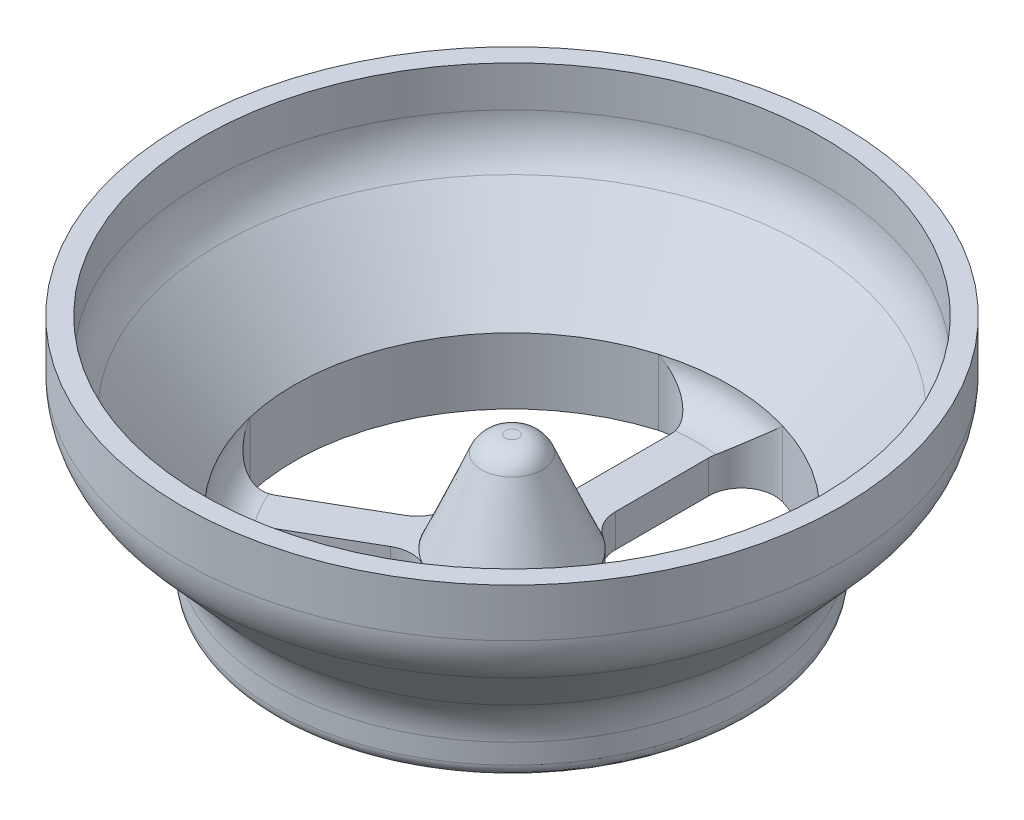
ISO-10303-21;
HEADER;
FILE_DESCRIPTION(('STEP AP214'),'2;1');
FILE_NAME('part.step','',(''),(''),'','','');
FILE_SCHEMA(('AUTOMOTIVE_DESIGN { 1 0 10303 214 1 1 1 1 }'));
ENDSEC;
DATA;
#1=APPLICATION_CONTEXT('core data for automotive mechanical design processes');
#2=APPLICATION_PROTOCOL_DEFINITION('international standard','automotive_design',2000,#1);
#3=PRODUCT_CONTEXT('',#1,'mechanical');
#4=PRODUCT('Part','Part','',(#3));
#5=PRODUCT_RELATED_PRODUCT_CATEGORY('part','',(#4));
#6=PRODUCT_DEFINITION_FORMATION('','',#4);
#7=PRODUCT_DEFINITION_CONTEXT('part definition',#1,'design');
#8=PRODUCT_DEFINITION('design','',#6,#7);
#9=PRODUCT_DEFINITION_SHAPE('','',#8);
#10=(LENGTH_UNIT() NAMED_UNIT(*) SI_UNIT(.MILLI.,.METRE.));
#11=(NAMED_UNIT(*) PLANE_ANGLE_UNIT() SI_UNIT($,.RADIAN.));
#12=(NAMED_UNIT(*) SI_UNIT($,.STERADIAN.) SOLID_ANGLE_UNIT());
#13=UNCERTAINTY_MEASURE_WITH_UNIT(LENGTH_MEASURE(1.E-05),#10,'distance_accuracy_value','');
#14=(GEOMETRIC_REPRESENTATION_CONTEXT(3) GLOBAL_UNCERTAINTY_ASSIGNED_CONTEXT((#13)) GLOBAL_UNIT_ASSIGNED_CONTEXT((#10,
#11,#12)) REPRESENTATION_CONTEXT('',''));
#15=CARTESIAN_POINT('',(0.,0.,0.));
#16=DIRECTION('',(0.,0.,1.));
#17=DIRECTION('',(1.,0.,0.));
#18=AXIS2_PLACEMENT_3D('',#15,#16,#17);
#19=CARTESIAN_POINT('',(0.,20.,0.));
#20=DIRECTION('',(0.,1.,0.));
#21=DIRECTION('',(-1.,0.,0.));
#22=AXIS2_PLACEMENT_3D('',#19,#20,#21);
#23=CYLINDRICAL_SURFACE('',#22,33.);
#24=CARTESIAN_POINT('',(0.,10.,0.));
#25=DIRECTION('',(0.,1.,0.));
#26=DIRECTION('',(-1.,0.,0.));
#27=AXIS2_PLACEMENT_3D('',#24,#25,#26);
#28=CIRCLE('',#27,33.);
#29=CARTESIAN_POINT('',(-22.6732393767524,9.99999999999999,23.9775773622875));
#30=VERTEX_POINT('',#29);
#31=CARTESIAN_POINT('',(22.6732393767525,10.,23.9775773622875));
#32=VERTEX_POINT('',#31);
#33=EDGE_CURVE('E543',#30,#32,#28,.T.);
#34=ORIENTED_EDGE('',*,*,#33,.T.);
#35=DIRECTION('',(0.,1.,0.));
#36=VECTOR('',#35,1.);
#37=CARTESIAN_POINT('',(22.6732393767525,20.,23.9775773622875));
#38=LINE('',#37,#36);
#39=CARTESIAN_POINT('',(22.6732393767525,0.,23.9775773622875));
#40=VERTEX_POINT('',#39);
#41=EDGE_CURVE('E350',#32,#40,#38,.F.);
#42=ORIENTED_EDGE('',*,*,#41,.T.);
#43=CARTESIAN_POINT('',(0.,0.,0.));
#44=DIRECTION('',(0.,1.,0.));
#45=DIRECTION('',(-1.,0.,0.));
#46=AXIS2_PLACEMENT_3D('',#43,#44,#45);
#47=CIRCLE('',#46,33.);
#48=CARTESIAN_POINT('',(-22.6732393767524,0.,23.9775773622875));
#49=VERTEX_POINT('',#48);
#50=EDGE_CURVE('E522',#49,#40,#47,.T.);
#51=ORIENTED_EDGE('',*,*,#50,.F.);
#52=DIRECTION('',(0.,1.,0.));
#53=VECTOR('',#52,1.);
#54=CARTESIAN_POINT('',(-22.6732393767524,20.,23.9775773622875));
#55=LINE('',#54,#53);
#56=EDGE_CURVE('E341',#49,#30,#55,.T.);
#57=ORIENTED_EDGE('',*,*,#56,.T.);
#58=EDGE_LOOP('',(#34,#42,#51,#57));
#59=FACE_BOUND('',#58,.T.);
#60=ADVANCED_FACE('F35',(#59),#23,.F.);
#61=CARTESIAN_POINT('',(32.1018108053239,0.,7.64681260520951));
#62=VERTEX_POINT('',#61);
#63=CARTESIAN_POINT('',(9.42857142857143,0.,-31.624389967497));
#64=VERTEX_POINT('',#63);
#65=EDGE_CURVE('E524',#62,#64,#47,.T.);
#66=ORIENTED_EDGE('',*,*,#65,.F.);
#67=DIRECTION('',(0.,1.,0.));
#68=VECTOR('',#67,1.);
#69=CARTESIAN_POINT('',(32.1018108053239,20.,7.64681260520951));
#70=LINE('',#69,#68);
#71=CARTESIAN_POINT('',(32.1018108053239,10.,7.64681260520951));
#72=VERTEX_POINT('',#71);
#73=EDGE_CURVE('E348',#62,#72,#70,.T.);
#74=ORIENTED_EDGE('',*,*,#73,.T.);
#75=CARTESIAN_POINT('',(9.42857142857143,10.,-31.624389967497));
#76=VERTEX_POINT('',#75);
#77=EDGE_CURVE('E536',#72,#76,#28,.T.);
#78=ORIENTED_EDGE('',*,*,#77,.T.);
#79=DIRECTION('',(0.,1.,0.));
#80=VECTOR('',#79,1.);
#81=CARTESIAN_POINT('',(9.42857142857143,20.,-31.624389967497));
#82=LINE('',#81,#80);
#83=EDGE_CURVE('E345',#76,#64,#82,.F.);
#84=ORIENTED_EDGE('',*,*,#83,.T.);
#85=EDGE_LOOP('',(#66,#74,#78,#84));
#86=FACE_BOUND('',#85,.T.);
#87=ADVANCED_FACE('F489',(#86),#23,.F.);
#88=CARTESIAN_POINT('',(0.,5.,0.));
#89=DIRECTION('',(0.,-1.,0.));
#90=DIRECTION('',(0.,0.,-1.));
#91=AXIS2_PLACEMENT_3D('',#88,#89,#90);
#92=CYLINDRICAL_SURFACE('',#91,10.);
#93=CARTESIAN_POINT('',(0.,5.,0.));
#94=DIRECTION('',(0.,1.,0.));
#95=DIRECTION('',(0.,0.,1.));
#96=AXIS2_PLACEMENT_3D('',#93,#94,#95);
#97=CIRCLE('',#96,10.);
#98=CARTESIAN_POINT('',(5.33333143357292,5.,-8.45905289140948));
#99=VERTEX_POINT('',#98);
#100=CARTESIAN_POINT('',(-5.33332953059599,5.,-8.45905409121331));
#101=VERTEX_POINT('',#100);
#102=EDGE_CURVE('E969',#99,#101,#97,.T.);
#103=ORIENTED_EDGE('',*,*,#102,.T.);
#104=CARTESIAN_POINT('',(-5.33333143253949,5.,-8.45905289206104));
#105=CARTESIAN_POINT('',(-5.33333151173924,4.99713204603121,-8.45905284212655));
#106=CARTESIAN_POINT('',(-5.33333159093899,4.99426409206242,-8.45905279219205));
#107=CARTESIAN_POINT('',(-5.33333174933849,4.98852818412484,-8.45905269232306));
#108=CARTESIAN_POINT('',(-5.33333182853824,4.98566023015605,-8.45905264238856));
#109=CARTESIAN_POINT('',(-5.33333198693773,4.97992432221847,-8.45905254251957));
#110=CARTESIAN_POINT('',(-5.33333206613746,4.97705636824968,-8.45905249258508));
#111=CARTESIAN_POINT('',(-5.33333222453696,4.9713204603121,-8.45905239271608));
#112=CARTESIAN_POINT('',(-5.33333230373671,4.96845250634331,-8.45905234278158));
#113=CARTESIAN_POINT('',(-5.3333324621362,4.96271659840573,-8.45905224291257));
#114=CARTESIAN_POINT('',(-5.33333254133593,4.95984864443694,-8.45905219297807));
#115=CARTESIAN_POINT('',(-5.33333269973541,4.95411273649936,-8.45905209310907));
#116=CARTESIAN_POINT('',(-5.33333277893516,4.95124478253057,-8.45905204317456));
#117=CARTESIAN_POINT('',(-5.33333293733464,4.94550887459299,-8.45905194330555));
#118=CARTESIAN_POINT('',(-5.33333301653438,4.94264092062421,-8.45905189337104));
#119=CARTESIAN_POINT('',(-5.33333317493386,4.93690501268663,-8.45905179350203));
#120=CARTESIAN_POINT('',(-5.3333332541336,4.93403705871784,-8.45905174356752));
#121=CARTESIAN_POINT('',(-5.33333333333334,4.93116910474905,-8.45905169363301));
#122=B_SPLINE_CURVE_WITH_KNOTS('',3,(#104,#105,#106,#107,#108,#109,#110,#111,#112,#113,#114,
#115,#116,#117,#118,#119,#120,#121),.UNSPECIFIED.,.F.,.F.,(4,2,2,2,2,2,2,2,4),(0.,
0.00860386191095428,0.0172077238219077,0.025811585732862,0.0344154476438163,0.0430193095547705,
0.0516231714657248,0.0602270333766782,0.0688308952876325),.UNSPECIFIED.);
#123=CARTESIAN_POINT('',(-5.33333333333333,4.93116910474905,-8.45905169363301));
#124=VERTEX_POINT('',#123);
#125=EDGE_CURVE('E649',#101,#124,#122,.T.);
#126=ORIENTED_EDGE('',*,*,#125,.T.);
#127=CARTESIAN_POINT('',(0.,4.93116910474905,0.));
#128=DIRECTION('',(0.,1.,0.));
#129=DIRECTION('',(-1.,0.,0.));
#130=AXIS2_PLACEMENT_3D('',#127,#128,#129);
#131=CIRCLE('',#130,10.);
#132=CARTESIAN_POINT('',(5.33333333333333,4.93116910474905,-8.45905169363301));
#133=VERTEX_POINT('',#132);
#134=EDGE_CURVE('E634',#133,#124,#131,.T.);
#135=ORIENTED_EDGE('',*,*,#134,.F.);
#136=CARTESIAN_POINT('',(5.33333143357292,5.,-8.45905289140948));
#137=CARTESIAN_POINT('',(5.33333151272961,4.99713204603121,-8.45905284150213));
#138=CARTESIAN_POINT('',(5.3333315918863,4.99426409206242,-8.45905279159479));
#139=CARTESIAN_POINT('',(5.33333175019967,4.98852818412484,-8.4590526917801));
#140=CARTESIAN_POINT('',(5.33333182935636,4.98566023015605,-8.45905264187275));
#141=CARTESIAN_POINT('',(5.33333198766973,4.97992432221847,-8.45905254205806));
#142=CARTESIAN_POINT('',(5.33333206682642,4.97705636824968,-8.45905249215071));
#143=CARTESIAN_POINT('',(5.33333222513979,4.9713204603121,-8.459052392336));
#144=CARTESIAN_POINT('',(5.33333230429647,4.96845250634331,-8.45905234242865));
#145=CARTESIAN_POINT('',(5.33333246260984,4.96271659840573,-8.45905224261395));
#146=CARTESIAN_POINT('',(5.33333254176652,4.95984864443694,-8.45905219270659));
#147=CARTESIAN_POINT('',(5.33333270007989,4.95411273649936,-8.45905209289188));
#148=CARTESIAN_POINT('',(5.33333277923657,4.95124478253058,-8.45905204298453));
#149=CARTESIAN_POINT('',(5.33333293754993,4.945508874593,-8.45905194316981));
#150=CARTESIAN_POINT('',(5.33333301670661,4.94264092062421,-8.45905189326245));
#151=CARTESIAN_POINT('',(5.33333317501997,4.93690501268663,-8.45905179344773));
#152=CARTESIAN_POINT('',(5.33333325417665,4.93403705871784,-8.45905174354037));
#153=CARTESIAN_POINT('',(5.33333333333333,4.93116910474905,-8.45905169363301));
#154=B_SPLINE_CURVE_WITH_KNOTS('',3,(#136,#137,#138,#139,#140,#141,#142,#143,#144,#145,#146,
#147,#148,#149,#150,#151,#152,#153),.UNSPECIFIED.,.F.,.F.,(4,2,2,2,2,2,2,2,4),(0.,
0.00860386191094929,0.0172077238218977,0.0258115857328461,0.0344154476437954,0.0430193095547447,
0.0516231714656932,0.0602270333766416,0.0688308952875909),.UNSPECIFIED.);
#155=EDGE_CURVE('E654',#133,#99,#154,.F.);
#156=ORIENTED_EDGE('',*,*,#155,.T.);
#157=EDGE_LOOP('',(#103,#126,#135,#156));
#158=FACE_BOUND('',#157,.T.);
#159=ADVANCED_FACE('F496',(#158),#92,.F.);
#160=CARTESIAN_POINT('',(33.,0.,0.));
#161=DIRECTION('',(0.,1.,0.));
#162=DIRECTION('',(-1.,0.,0.));
#163=AXIS2_PLACEMENT_3D('',#160,#161,#162);
#164=PLANE('',#163);
#165=CARTESIAN_POINT('',(0.,0.,0.));
#166=DIRECTION('',(0.,1.,0.));
#167=DIRECTION('',(-1.,0.,0.));
#168=AXIS2_PLACEMENT_3D('',#165,#166,#167);
#169=CIRCLE('',#168,34.);
#170=CARTESIAN_POINT('',(-34.,0.,0.));
#171=VERTEX_POINT('',#170);
#172=EDGE_CURVE('E11',#171,#171,#169,.F.);
#173=ORIENTED_EDGE('',*,*,#172,.T.);
#174=EDGE_LOOP('',(#173));
#175=FACE_BOUND('',#174,.T.);
#176=DIRECTION('',(0.,0.,1.));
#177=VECTOR('',#176,1.);
#178=CARTESIAN_POINT('',(-3.,0.,0.));
#179=LINE('',#178,#177);
#180=CARTESIAN_POINT('',(-3.,0.,-26.8328157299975));
#181=VERTEX_POINT('',#180);
#182=CARTESIAN_POINT('',(-3.,0.,-12.6885775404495));
#183=VERTEX_POINT('',#182);
#184=EDGE_CURVE('E977',#181,#183,#179,.T.);
#185=ORIENTED_EDGE('',*,*,#184,.F.);
#186=CARTESIAN_POINT('',(-8.,0.,-26.8328157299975));
#187=DIRECTION('',(0.,1.,0.));
#188=DIRECTION('',(-1.,0.,0.));
#189=AXIS2_PLACEMENT_3D('',#186,#187,#188);
#190=CIRCLE('',#189,5.);
#191=CARTESIAN_POINT('',(-9.42857142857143,0.,-31.624389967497));
#192=VERTEX_POINT('',#191);
#193=EDGE_CURVE('E383',#181,#192,#190,.T.);
#194=ORIENTED_EDGE('',*,*,#193,.T.);
#195=CARTESIAN_POINT('',(-32.1018108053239,0.,7.64681260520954));
#196=VERTEX_POINT('',#195);
#197=EDGE_CURVE('E516',#192,#196,#47,.T.);
#198=ORIENTED_EDGE('',*,*,#197,.T.);
#199=CARTESIAN_POINT('',(-27.2379000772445,0.,6.48820463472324));
#200=DIRECTION('',(0.,1.,0.));
#201=DIRECTION('',(-1.,0.,0.));
#202=AXIS2_PLACEMENT_3D('',#199,#200,#201);
#203=CIRCLE('',#202,5.);
#204=CARTESIAN_POINT('',(-24.7379000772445,0.,10.8183316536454));
#205=VERTEX_POINT('',#204);
#206=EDGE_CURVE('E391',#196,#205,#203,.T.);
#207=ORIENTED_EDGE('',*,*,#206,.T.);
#208=DIRECTION('',(0.866025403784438,0.,-0.500000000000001));
#209=VECTOR('',#208,1.);
#210=CARTESIAN_POINT('',(-1.5,0.,-2.59807621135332));
#211=LINE('',#210,#209);
#212=CARTESIAN_POINT('',(-12.488630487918,0.,3.74621255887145));
#213=VERTEX_POINT('',#212);
#214=EDGE_CURVE('E995',#205,#213,#211,.T.);
#215=ORIENTED_EDGE('',*,*,#214,.T.);
#216=CARTESIAN_POINT('',(-14.988630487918,0.,-0.583914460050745));
#217=DIRECTION('',(0.,1.,0.));
#218=DIRECTION('',(-1.,0.,0.));
#219=AXIS2_PLACEMENT_3D('',#216,#217,#218);
#220=CIRCLE('',#219,5.);
#221=CARTESIAN_POINT('',(-9.99242032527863,0.,-0.389276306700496));
#222=VERTEX_POINT('',#221);
#223=EDGE_CURVE('E1026',#213,#222,#220,.T.);
#224=ORIENTED_EDGE('',*,*,#223,.T.);
#225=CARTESIAN_POINT('',(0.,0.,0.));
#226=DIRECTION('',(0.,1.,0.));
#227=DIRECTION('',(0.,0.,1.));
#228=AXIS2_PLACEMENT_3D('',#225,#226,#227);
#229=CIRCLE('',#228,10.);
#230=CARTESIAN_POINT('',(-4.6590869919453,0.,8.84832800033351));
#231=VERTEX_POINT('',#230);
#232=EDGE_CURVE('E994',#222,#231,#229,.T.);
#233=ORIENTED_EDGE('',*,*,#232,.T.);
#234=CARTESIAN_POINT('',(-6.98863048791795,0.,13.2724920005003));
#235=DIRECTION('',(0.,1.,0.));
#236=DIRECTION('',(-1.,0.,0.));
#237=AXIS2_PLACEMENT_3D('',#234,#235,#236);
#238=CIRCLE('',#237,5.);
#239=CARTESIAN_POINT('',(-9.48863048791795,0.,8.94236498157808));
#240=VERTEX_POINT('',#239);
#241=EDGE_CURVE('E328',#231,#240,#238,.T.);
#242=ORIENTED_EDGE('',*,*,#241,.T.);
#243=DIRECTION('',(0.866025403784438,0.,-0.500000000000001));
#244=VECTOR('',#243,1.);
#245=CARTESIAN_POINT('',(1.5,0.,2.59807621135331));
#246=LINE('',#245,#244);
#247=CARTESIAN_POINT('',(-21.7379000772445,0.,16.0144840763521));
#248=VERTEX_POINT('',#247);
#249=EDGE_CURVE('E999',#248,#240,#246,.T.);
#250=ORIENTED_EDGE('',*,*,#249,.F.);
#251=CARTESIAN_POINT('',(-19.2379000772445,0.,20.3446110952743));
#252=DIRECTION('',(0.,1.,0.));
#253=DIRECTION('',(-1.,0.,0.));
#254=AXIS2_PLACEMENT_3D('',#251,#252,#253);
#255=CIRCLE('',#254,5.);
#256=EDGE_CURVE('E387',#248,#49,#255,.T.);
#257=ORIENTED_EDGE('',*,*,#256,.T.);
#258=ORIENTED_EDGE('',*,*,#50,.T.);
#259=CARTESIAN_POINT('',(19.2379000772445,0.,20.3446110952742));
#260=DIRECTION('',(0.,1.,0.));
#261=DIRECTION('',(-1.,0.,0.));
#262=AXIS2_PLACEMENT_3D('',#259,#260,#261);
#263=CIRCLE('',#262,5.);
#264=CARTESIAN_POINT('',(21.7379000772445,0.,16.0144840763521));
#265=VERTEX_POINT('',#264);
#266=EDGE_CURVE('E369',#40,#265,#263,.T.);
#267=ORIENTED_EDGE('',*,*,#266,.T.);
#268=DIRECTION('',(-0.866025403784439,0.,-0.5));
#269=VECTOR('',#268,1.);
#270=CARTESIAN_POINT('',(-1.5,0.,2.59807621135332));
#271=LINE('',#270,#269);
#272=CARTESIAN_POINT('',(9.48863048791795,0.,8.94236498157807));
#273=VERTEX_POINT('',#272);
#274=EDGE_CURVE('E242',#265,#273,#271,.T.);
#275=ORIENTED_EDGE('',*,*,#274,.T.);
#276=CARTESIAN_POINT('',(6.98863048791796,0.,13.2724920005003));
#277=DIRECTION('',(0.,1.,0.));
#278=DIRECTION('',(-1.,0.,0.));
#279=AXIS2_PLACEMENT_3D('',#276,#277,#278);
#280=CIRCLE('',#279,5.);
#281=CARTESIAN_POINT('',(4.65908699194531,0.,8.84832800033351));
#282=VERTEX_POINT('',#281);
#283=EDGE_CURVE('E337',#273,#282,#280,.T.);
#284=ORIENTED_EDGE('',*,*,#283,.T.);
#285=CARTESIAN_POINT('',(0.,0.,0.));
#286=DIRECTION('',(0.,1.,0.));
#287=DIRECTION('',(0.,0.,1.));
#288=AXIS2_PLACEMENT_3D('',#285,#286,#287);
#289=CIRCLE('',#288,10.);
#290=CARTESIAN_POINT('',(9.99242032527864,0.,-0.389276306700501));
#291=VERTEX_POINT('',#290);
#292=EDGE_CURVE('E249',#282,#291,#289,.T.);
#293=ORIENTED_EDGE('',*,*,#292,.T.);
#294=CARTESIAN_POINT('',(14.988630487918,0.,-0.583914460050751));
#295=DIRECTION('',(0.,1.,0.));
#296=DIRECTION('',(-1.,0.,0.));
#297=AXIS2_PLACEMENT_3D('',#294,#295,#296);
#298=CIRCLE('',#297,5.);
#299=CARTESIAN_POINT('',(12.488630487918,0.,3.74621255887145));
#300=VERTEX_POINT('',#299);
#301=EDGE_CURVE('E245',#291,#300,#298,.T.);
#302=ORIENTED_EDGE('',*,*,#301,.T.);
#303=DIRECTION('',(-0.866025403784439,0.,-0.5));
#304=VECTOR('',#303,1.);
#305=CARTESIAN_POINT('',(1.5,0.,-2.59807621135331));
#306=LINE('',#305,#304);
#307=CARTESIAN_POINT('',(24.7379000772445,0.,10.8183316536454));
#308=VERTEX_POINT('',#307);
#309=EDGE_CURVE('E231',#308,#300,#306,.T.);
#310=ORIENTED_EDGE('',*,*,#309,.F.);
#311=CARTESIAN_POINT('',(27.2379000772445,0.,6.48820463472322));
#312=DIRECTION('',(0.,1.,0.));
#313=DIRECTION('',(-1.,0.,0.));
#314=AXIS2_PLACEMENT_3D('',#311,#312,#313);
#315=CIRCLE('',#314,5.);
#316=EDGE_CURVE('E374',#308,#62,#315,.T.);
#317=ORIENTED_EDGE('',*,*,#316,.T.);
#318=ORIENTED_EDGE('',*,*,#65,.T.);
#319=CARTESIAN_POINT('',(8.,0.,-26.8328157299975));
#320=DIRECTION('',(0.,1.,0.));
#321=DIRECTION('',(-1.,0.,0.));
#322=AXIS2_PLACEMENT_3D('',#319,#320,#321);
#323=CIRCLE('',#322,5.);
#324=CARTESIAN_POINT('',(3.,0.,-26.8328157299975));
#325=VERTEX_POINT('',#324);
#326=EDGE_CURVE('E378',#64,#325,#323,.T.);
#327=ORIENTED_EDGE('',*,*,#326,.T.);
#328=DIRECTION('',(0.,0.,1.));
#329=VECTOR('',#328,1.);
#330=CARTESIAN_POINT('',(3.,0.,0.));
#331=LINE('',#330,#329);
#332=CARTESIAN_POINT('',(3.,0.,-12.6885775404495));
#333=VERTEX_POINT('',#332);
#334=EDGE_CURVE('E975',#325,#333,#331,.T.);
#335=ORIENTED_EDGE('',*,*,#334,.T.);
#336=CARTESIAN_POINT('',(8.,0.,-12.6885775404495));
#337=DIRECTION('',(0.,1.,0.));
#338=DIRECTION('',(-1.,0.,0.));
#339=AXIS2_PLACEMENT_3D('',#336,#337,#338);
#340=CIRCLE('',#339,5.);
#341=CARTESIAN_POINT('',(5.33333333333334,0.,-8.45905169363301));
#342=VERTEX_POINT('',#341);
#343=EDGE_CURVE('E659',#333,#342,#340,.T.);
#344=ORIENTED_EDGE('',*,*,#343,.T.);
#345=CARTESIAN_POINT('',(0.,0.,0.));
#346=DIRECTION('',(0.,1.,0.));
#347=DIRECTION('',(0.,0.,1.));
#348=AXIS2_PLACEMENT_3D('',#345,#346,#347);
#349=CIRCLE('',#348,10.);
#350=CARTESIAN_POINT('',(-5.33333333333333,0.,-8.45905169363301));
#351=VERTEX_POINT('',#350);
#352=EDGE_CURVE('E973',#342,#351,#349,.T.);
#353=ORIENTED_EDGE('',*,*,#352,.T.);
#354=CARTESIAN_POINT('',(-8.,0.,-12.6885775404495));
#355=DIRECTION('',(0.,1.,0.));
#356=DIRECTION('',(-1.,0.,0.));
#357=AXIS2_PLACEMENT_3D('',#354,#355,#356);
#358=CIRCLE('',#357,5.);
#359=EDGE_CURVE('E652',#351,#183,#358,.T.);
#360=ORIENTED_EDGE('',*,*,#359,.T.);
#361=EDGE_LOOP('',(#185,#194,#198,#207,#215,#224,#233,#242,#250,#257,#258,#267,#275,#284,#293,
#302,#310,#317,#318,#327,#335,#344,#353,#360));
#362=FACE_BOUND('',#361,.T.);
#363=ADVANCED_FACE('F247',(#175,#362),#164,.F.);
#364=CARTESIAN_POINT('',(0.,20.,0.));
#365=DIRECTION('',(0.,1.,0.));
#366=DIRECTION('',(-1.,0.,0.));
#367=AXIS2_PLACEMENT_3D('',#364,#365,#366);
#368=CYLINDRICAL_SURFACE('',#367,36.);
#369=CARTESIAN_POINT('',(0.,1.99999999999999,0.));
#370=DIRECTION('',(0.,1.,0.));
#371=DIRECTION('',(-1.,0.,0.));
#372=AXIS2_PLACEMENT_3D('',#369,#370,#371);
#373=CIRCLE('',#372,36.);
#374=CARTESIAN_POINT('',(-36.,1.99999999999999,0.));
#375=VERTEX_POINT('',#374);
#376=EDGE_CURVE('E43',#375,#375,#373,.T.);
#377=ORIENTED_EDGE('',*,*,#376,.T.);
#378=EDGE_LOOP('',(#377));
#379=FACE_BOUND('',#378,.T.);
#380=CARTESIAN_POINT('',(0.,5.0097675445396,0.));
#381=DIRECTION('',(0.,1.,0.));
#382=DIRECTION('',(-1.,0.,0.));
#383=AXIS2_PLACEMENT_3D('',#380,#381,#382);
#384=CIRCLE('',#383,36.);
#385=CARTESIAN_POINT('',(-36.,5.0097675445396,0.));
#386=VERTEX_POINT('',#385);
#387=EDGE_CURVE('E262',#386,#386,#384,.T.);
#388=ORIENTED_EDGE('',*,*,#387,.F.);
#389=EDGE_LOOP('',(#388));
#390=FACE_BOUND('',#389,.T.);
#391=ADVANCED_FACE('F478',(#379,#390),#368,.T.);
#392=CARTESIAN_POINT('',(0.,5.0097675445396,0.));
#393=DIRECTION('',(0.,1.,0.));
#394=DIRECTION('',(-1.,0.,0.));
#395=AXIS2_PLACEMENT_3D('',#392,#393,#394);
#396=TOROIDAL_SURFACE('',#395,46.,10.);
#397=CARTESIAN_POINT('',(0.,11.7010736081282,0.));
#398=DIRECTION('',(0.,1.,0.));
#399=DIRECTION('',(-1.,0.,0.));
#400=AXIS2_PLACEMENT_3D('',#397,#398,#399);
#401=CIRCLE('',#400,38.5685517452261);
#402=CARTESIAN_POINT('',(-38.5685517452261,11.7010736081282,0.));
#403=VERTEX_POINT('',#402);
#404=EDGE_CURVE('E268',#403,#403,#401,.T.);
#405=ORIENTED_EDGE('',*,*,#404,.F.);
#406=EDGE_LOOP('',(#405));
#407=FACE_BOUND('',#406,.T.);
#408=ORIENTED_EDGE('',*,*,#387,.T.);
#409=EDGE_LOOP('',(#408));
#410=FACE_BOUND('',#409,.T.);
#411=ADVANCED_FACE('F566',(#407,#410),#396,.F.);
#412=CARTESIAN_POINT('',(0.,11.7010736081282,0.));
#413=DIRECTION('',(0.,1.,0.));
#414=DIRECTION('',(-1.,0.,0.));
#415=AXIS2_PLACEMENT_3D('',#412,#413,#414);
#416=CONICAL_SURFACE('',#415,38.5685517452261,0.733038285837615);
#417=CARTESIAN_POINT('',(0.,21.5443173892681,0.));
#418=DIRECTION('',(0.,1.,0.));
#419=DIRECTION('',(-1.,0.,0.));
#420=AXIS2_PLACEMENT_3D('',#417,#418,#419);
#421=CIRCLE('',#420,47.431448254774);
#422=CARTESIAN_POINT('',(-47.431448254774,21.5443173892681,0.));
#423=VERTEX_POINT('',#422);
#424=EDGE_CURVE('E559',#423,#423,#421,.T.);
#425=ORIENTED_EDGE('',*,*,#424,.F.);
#426=EDGE_LOOP('',(#425));
#427=FACE_BOUND('',#426,.T.);
#428=ORIENTED_EDGE('',*,*,#404,.T.);
#429=EDGE_LOOP('',(#428));
#430=FACE_BOUND('',#429,.T.);
#431=ADVANCED_FACE('F564',(#427,#430),#416,.T.);
#432=CARTESIAN_POINT('',(0.,28.2356234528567,0.));
#433=DIRECTION('',(0.,1.,0.));
#434=DIRECTION('',(-1.,0.,0.));
#435=AXIS2_PLACEMENT_3D('',#432,#433,#434);
#436=TOROIDAL_SURFACE('',#435,40.,10.);
#437=CARTESIAN_POINT('',(0.,28.2356234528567,0.));
#438=DIRECTION('',(0.,1.,0.));
#439=DIRECTION('',(-1.,0.,0.));
#440=AXIS2_PLACEMENT_3D('',#437,#438,#439);
#441=CIRCLE('',#440,50.);
#442=CARTESIAN_POINT('',(-50.,28.2356234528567,0.));
#443=VERTEX_POINT('',#442);
#444=EDGE_CURVE('E556',#443,#443,#441,.T.);
#445=ORIENTED_EDGE('',*,*,#444,.F.);
#446=EDGE_LOOP('',(#445));
#447=FACE_BOUND('',#446,.T.);
#448=ORIENTED_EDGE('',*,*,#424,.T.);
#449=EDGE_LOOP('',(#448));
#450=FACE_BOUND('',#449,.T.);
#451=ADVANCED_FACE('F1068',(#447,#450),#436,.T.);
#452=CARTESIAN_POINT('',(0.,20.,0.));
#453=DIRECTION('',(0.,1.,0.));
#454=DIRECTION('',(-1.,0.,0.));
#455=AXIS2_PLACEMENT_3D('',#452,#453,#454);
#456=CYLINDRICAL_SURFACE('',#455,50.);
#457=CARTESIAN_POINT('',(0.,35.5485752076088,0.));
#458=DIRECTION('',(0.,1.,0.));
#459=DIRECTION('',(-1.,0.,0.));
#460=AXIS2_PLACEMENT_3D('',#457,#458,#459);
#461=CIRCLE('',#460,50.);
#462=CARTESIAN_POINT('',(-50.,35.5485752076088,0.));
#463=VERTEX_POINT('',#462);
#464=EDGE_CURVE('E553',#463,#463,#461,.T.);
#465=ORIENTED_EDGE('',*,*,#464,.F.);
#466=EDGE_LOOP('',(#465));
#467=FACE_BOUND('',#466,.T.);
#468=ORIENTED_EDGE('',*,*,#444,.T.);
#469=EDGE_LOOP('',(#468));
#470=FACE_BOUND('',#469,.T.);
#471=ADVANCED_FACE('F1062',(#467,#470),#456,.T.);
#472=CARTESIAN_POINT('',(47.,35.5485752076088,0.));
#473=DIRECTION('',(0.,-1.,0.));
#474=DIRECTION('',(1.,0.,0.));
#475=AXIS2_PLACEMENT_3D('',#472,#473,#474);
#476=PLANE('',#475);
#477=CARTESIAN_POINT('',(0.,35.5485752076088,0.));
#478=DIRECTION('',(0.,1.,0.));
#479=DIRECTION('',(-1.,0.,0.));
#480=AXIS2_PLACEMENT_3D('',#477,#478,#479);
#481=CIRCLE('',#480,47.);
#482=CARTESIAN_POINT('',(-47.,35.5485752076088,0.));
#483=VERTEX_POINT('',#482);
#484=EDGE_CURVE('E550',#483,#483,#481,.T.);
#485=ORIENTED_EDGE('',*,*,#484,.F.);
#486=EDGE_LOOP('',(#485));
#487=FACE_BOUND('',#486,.T.);
#488=ORIENTED_EDGE('',*,*,#464,.T.);
#489=EDGE_LOOP('',(#488));
#490=FACE_BOUND('',#489,.T.);
#491=ADVANCED_FACE('F1056',(#487,#490),#476,.F.);
#492=CARTESIAN_POINT('',(0.,20.,0.));
#493=DIRECTION('',(0.,1.,0.));
#494=DIRECTION('',(-1.,0.,0.));
#495=AXIS2_PLACEMENT_3D('',#492,#493,#494);
#496=CYLINDRICAL_SURFACE('',#495,47.);
#497=CARTESIAN_POINT('',(0.,29.3872155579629,0.));
#498=DIRECTION('',(0.,1.,0.));
#499=DIRECTION('',(-1.,0.,0.));
#500=AXIS2_PLACEMENT_3D('',#497,#498,#499);
#501=CIRCLE('',#500,47.);
#502=CARTESIAN_POINT('',(-47.,29.3872155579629,0.));
#503=VERTEX_POINT('',#502);
#504=EDGE_CURVE('E547',#503,#503,#501,.T.);
#505=ORIENTED_EDGE('',*,*,#504,.F.);
#506=EDGE_LOOP('',(#505));
#507=FACE_BOUND('',#506,.T.);
#508=ORIENTED_EDGE('',*,*,#484,.T.);
#509=EDGE_LOOP('',(#508));
#510=FACE_BOUND('',#509,.T.);
#511=ADVANCED_FACE('F1050',(#507,#510),#496,.F.);
#512=CARTESIAN_POINT('',(0.,29.3872155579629,0.));
#513=DIRECTION('',(0.,1.,0.));
#514=DIRECTION('',(-1.,0.,0.));
#515=AXIS2_PLACEMENT_3D('',#512,#513,#514);
#516=TOROIDAL_SURFACE('',#515,37.,10.);
#517=CARTESIAN_POINT('',(0.,22.6959094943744,0.));
#518=DIRECTION('',(0.,1.,0.));
#519=DIRECTION('',(-1.,0.,0.));
#520=AXIS2_PLACEMENT_3D('',#517,#518,#519);
#521=CIRCLE('',#520,44.431448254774);
#522=CARTESIAN_POINT('',(-44.431448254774,22.6959094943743,0.));
#523=VERTEX_POINT('',#522);
#524=EDGE_CURVE('E542',#523,#523,#521,.T.);
#525=ORIENTED_EDGE('',*,*,#524,.F.);
#526=EDGE_LOOP('',(#525));
#527=FACE_BOUND('',#526,.T.);
#528=ORIENTED_EDGE('',*,*,#504,.T.);
#529=EDGE_LOOP('',(#528));
#530=FACE_BOUND('',#529,.T.);
#531=ADVANCED_FACE('F512',(#527,#530),#516,.F.);
#532=CARTESIAN_POINT('',(0.,22.6959094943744,0.));
#533=DIRECTION('',(0.,1.,0.));
#534=DIRECTION('',(-1.,0.,0.));
#535=AXIS2_PLACEMENT_3D('',#532,#533,#534);
#536=CONICAL_SURFACE('',#535,44.431448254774,0.733038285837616);
#537=CARTESIAN_POINT('',(-32.1018108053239,9.99999999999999,7.64681260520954));
#538=VERTEX_POINT('',#537);
#539=EDGE_CURVE('E539',#538,#30,#28,.T.);
#540=ORIENTED_EDGE('',*,*,#539,.F.);
#541=CARTESIAN_POINT('',(-9.42857142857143,9.99999999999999,-31.624389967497));
#542=VERTEX_POINT('',#541);
#543=EDGE_CURVE('E521',#542,#538,#28,.T.);
#544=ORIENTED_EDGE('',*,*,#543,.F.);
#545=EDGE_CURVE('E531',#76,#542,#28,.T.);
#546=ORIENTED_EDGE('',*,*,#545,.F.);
#547=ORIENTED_EDGE('',*,*,#77,.F.);
#548=EDGE_CURVE('E538',#32,#72,#28,.T.);
#549=ORIENTED_EDGE('',*,*,#548,.F.);
#550=ORIENTED_EDGE('',*,*,#33,.F.);
#551=EDGE_LOOP('',(#540,#544,#546,#547,#549,#550));
#552=FACE_BOUND('',#551,.T.);
#553=ORIENTED_EDGE('',*,*,#524,.T.);
#554=EDGE_LOOP('',(#553));
#555=FACE_BOUND('',#554,.T.);
#556=ADVANCED_FACE('F503',(#552,#555),#536,.F.);
#557=ORIENTED_EDGE('',*,*,#197,.F.);
#558=DIRECTION('',(0.,1.,0.));
#559=VECTOR('',#558,1.);
#560=CARTESIAN_POINT('',(-9.42857142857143,20.,-31.624389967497));
#561=LINE('',#560,#559);
#562=EDGE_CURVE('E343',#192,#542,#561,.T.);
#563=ORIENTED_EDGE('',*,*,#562,.T.);
#564=ORIENTED_EDGE('',*,*,#543,.T.);
#565=DIRECTION('',(0.,1.,0.));
#566=VECTOR('',#565,1.);
#567=CARTESIAN_POINT('',(-32.1018108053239,20.,7.64681260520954));
#568=LINE('',#567,#566);
#569=EDGE_CURVE('E339',#538,#196,#568,.F.);
#570=ORIENTED_EDGE('',*,*,#569,.T.);
#571=EDGE_LOOP('',(#557,#563,#564,#570));
#572=FACE_BOUND('',#571,.T.);
#573=ADVANCED_FACE('F492',(#572),#23,.F.);
#574=CARTESIAN_POINT('',(3.,5.,0.));
#575=DIRECTION('',(1.,0.,0.));
#576=DIRECTION('',(0.,0.,-1.));
#577=AXIS2_PLACEMENT_3D('',#574,#575,#576);
#578=PLANE('',#577);
#579=ORIENTED_EDGE('',*,*,#334,.F.);
#580=DIRECTION('',(0.,1.,0.));
#581=VECTOR('',#580,1.);
#582=CARTESIAN_POINT('',(3.,5.,-26.8328157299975));
#583=LINE('',#582,#581);
#584=CARTESIAN_POINT('',(3.,5.,-26.8328157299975));
#585=VERTEX_POINT('',#584);
#586=EDGE_CURVE('E358',#325,#585,#583,.T.);
#587=ORIENTED_EDGE('',*,*,#586,.T.);
#588=DIRECTION('',(0.,0.,1.));
#589=VECTOR('',#588,1.);
#590=CARTESIAN_POINT('',(3.,5.,0.));
#591=LINE('',#590,#589);
#592=CARTESIAN_POINT('',(3.,5.,-12.6885775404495));
#593=VERTEX_POINT('',#592);
#594=EDGE_CURVE('E966',#585,#593,#591,.T.);
#595=ORIENTED_EDGE('',*,*,#594,.T.);
#596=DIRECTION('',(0.,1.,0.));
#597=VECTOR('',#596,1.);
#598=CARTESIAN_POINT('',(3.,5.,-12.6885775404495));
#599=LINE('',#598,#597);
#600=EDGE_CURVE('E285',#593,#333,#599,.F.);
#601=ORIENTED_EDGE('',*,*,#600,.T.);
#602=EDGE_LOOP('',(#579,#587,#595,#601));
#603=FACE_BOUND('',#602,.T.);
#604=ADVANCED_FACE('F502',(#603),#578,.T.);
#605=CARTESIAN_POINT('',(-3.,5.,0.));
#606=DIRECTION('',(1.,0.,0.));
#607=DIRECTION('',(0.,0.,-1.));
#608=AXIS2_PLACEMENT_3D('',#605,#606,#607);
#609=PLANE('',#608);
#610=DIRECTION('',(0.,0.,1.));
#611=VECTOR('',#610,1.);
#612=CARTESIAN_POINT('',(-3.,5.,0.));
#613=LINE('',#612,#611);
#614=CARTESIAN_POINT('',(-3.,5.,-26.8328157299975));
#615=VERTEX_POINT('',#614);
#616=CARTESIAN_POINT('',(-3.,5.,-12.6885775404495));
#617=VERTEX_POINT('',#616);
#618=EDGE_CURVE('E964',#615,#617,#613,.T.);
#619=ORIENTED_EDGE('',*,*,#618,.F.);
#620=DIRECTION('',(0.,-1.,0.));
#621=VECTOR('',#620,1.);
#622=CARTESIAN_POINT('',(-3.,0.,-26.8328157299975));
#623=LINE('',#622,#621);
#624=EDGE_CURVE('E362',#615,#181,#623,.T.);
#625=ORIENTED_EDGE('',*,*,#624,.T.);
#626=ORIENTED_EDGE('',*,*,#184,.T.);
#627=DIRECTION('',(0.,-1.,0.));
#628=VECTOR('',#627,1.);
#629=CARTESIAN_POINT('',(-3.,20.,-12.6885775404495));
#630=LINE('',#629,#628);
#631=EDGE_CURVE('E288',#183,#617,#630,.F.);
#632=ORIENTED_EDGE('',*,*,#631,.T.);
#633=EDGE_LOOP('',(#619,#625,#626,#632));
#634=FACE_BOUND('',#633,.T.);
#635=ADVANCED_FACE('F509',(#634),#609,.F.);
#636=CARTESIAN_POINT('',(0.,5.,0.));
#637=DIRECTION('',(0.,1.,0.));
#638=DIRECTION('',(0.,0.,1.));
#639=AXIS2_PLACEMENT_3D('',#636,#637,#638);
#640=PLANE('',#639);
#641=CARTESIAN_POINT('',(8.,5.,-26.8328157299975));
#642=DIRECTION('',(0.,1.,0.));
#643=DIRECTION('',(0.,0.,1.));
#644=AXIS2_PLACEMENT_3D('',#641,#642,#643);
#645=CIRCLE('',#644,5.);
#646=CARTESIAN_POINT('',(3.1000120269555,5.,-27.8278623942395));
#647=VERTEX_POINT('',#646);
#648=EDGE_CURVE('E380',#585,#647,#645,.F.);
#649=ORIENTED_EDGE('',*,*,#648,.T.);
#650=CARTESIAN_POINT('',(0.,5.,0.));
#651=DIRECTION('',(0.,1.,0.));
#652=DIRECTION('',(0.,0.,1.));
#653=AXIS2_PLACEMENT_3D('',#650,#651,#652);
#654=CIRCLE('',#653,28.);
#655=CARTESIAN_POINT('',(-3.1000120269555,5.,-27.8278623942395));
#656=VERTEX_POINT('',#655);
#657=EDGE_CURVE('E360',#647,#656,#654,.T.);
#658=ORIENTED_EDGE('',*,*,#657,.T.);
#659=CARTESIAN_POINT('',(-8.,5.,-26.8328157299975));
#660=DIRECTION('',(0.,1.,0.));
#661=DIRECTION('',(0.,0.,1.));
#662=AXIS2_PLACEMENT_3D('',#659,#660,#661);
#663=CIRCLE('',#662,5.);
#664=EDGE_CURVE('E385',#656,#615,#663,.F.);
#665=ORIENTED_EDGE('',*,*,#664,.T.);
#666=ORIENTED_EDGE('',*,*,#618,.T.);
#667=CARTESIAN_POINT('',(-8.,5.,-12.6885775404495));
#668=DIRECTION('',(0.,1.,0.));
#669=DIRECTION('',(0.,0.,1.));
#670=AXIS2_PLACEMENT_3D('',#667,#668,#669);
#671=CIRCLE('',#670,5.);
#672=EDGE_CURVE('E653',#617,#101,#671,.F.);
#673=ORIENTED_EDGE('',*,*,#672,.T.);
#674=ORIENTED_EDGE('',*,*,#102,.F.);
#675=CARTESIAN_POINT('',(8.,5.,-12.6885775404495));
#676=DIRECTION('',(0.,1.,0.));
#677=DIRECTION('',(0.,0.,1.));
#678=AXIS2_PLACEMENT_3D('',#675,#676,#677);
#679=CIRCLE('',#678,5.);
#680=EDGE_CURVE('E253',#99,#593,#679,.F.);
#681=ORIENTED_EDGE('',*,*,#680,.T.);
#682=ORIENTED_EDGE('',*,*,#594,.F.);
#683=EDGE_LOOP('',(#649,#658,#665,#666,#673,#674,#681,#682));
#684=FACE_BOUND('',#683,.T.);
#685=ADVANCED_FACE('F682',(#684),#640,.T.);
#686=CARTESIAN_POINT('',(5.,-0.0688308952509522,0.));
#687=DIRECTION('',(0.,1.,0.));
#688=DIRECTION('',(-1.,0.,0.));
#689=AXIS2_PLACEMENT_3D('',#686,#687,#688);
#690=PLANE('',#689);
#691=CARTESIAN_POINT('',(0.,-0.0688308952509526,0.));
#692=DIRECTION('',(0.,1.,0.));
#693=DIRECTION('',(-1.,0.,0.));
#694=AXIS2_PLACEMENT_3D('',#691,#692,#693);
#695=CIRCLE('',#694,7.);
#696=CARTESIAN_POINT('',(-6.99999999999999,-0.0688308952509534,0.));
#697=VERTEX_POINT('',#696);
#698=EDGE_CURVE('E395',#697,#697,#695,.T.);
#699=ORIENTED_EDGE('',*,*,#698,.T.);
#700=EDGE_LOOP('',(#699));
#701=FACE_BOUND('',#700,.T.);
#702=CARTESIAN_POINT('',(0.,-0.0688308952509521,0.));
#703=DIRECTION('',(0.,1.,0.));
#704=DIRECTION('',(-1.,0.,0.));
#705=AXIS2_PLACEMENT_3D('',#702,#703,#704);
#706=CIRCLE('',#705,10.);
#707=CARTESIAN_POINT('',(-10.,-0.0688308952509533,0.));
#708=VERTEX_POINT('',#707);
#709=EDGE_CURVE('E638',#708,#708,#706,.T.);
#710=ORIENTED_EDGE('',*,*,#709,.F.);
#711=EDGE_LOOP('',(#710));
#712=FACE_BOUND('',#711,.T.);
#713=ADVANCED_FACE('F686',(#701,#712),#690,.F.);
#714=CARTESIAN_POINT('',(0.,20.,0.));
#715=DIRECTION('',(0.,1.,0.));
#716=DIRECTION('',(-1.,0.,0.));
#717=AXIS2_PLACEMENT_3D('',#714,#715,#716);
#718=CYLINDRICAL_SURFACE('',#717,5.);
#719=CARTESIAN_POINT('',(0.,1.93116910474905,0.));
#720=DIRECTION('',(0.,1.,0.));
#721=DIRECTION('',(-1.,0.,0.));
#722=AXIS2_PLACEMENT_3D('',#719,#720,#721);
#723=CIRCLE('',#722,5.);
#724=CARTESIAN_POINT('',(-4.99999999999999,1.93116910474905,0.));
#725=VERTEX_POINT('',#724);
#726=EDGE_CURVE('E473',#725,#725,#723,.F.);
#727=ORIENTED_EDGE('',*,*,#726,.T.);
#728=EDGE_LOOP('',(#727));
#729=FACE_BOUND('',#728,.T.);
#730=CARTESIAN_POINT('',(0.,10.,0.));
#731=DIRECTION('',(0.,1.,0.));
#732=DIRECTION('',(-1.,0.,0.));
#733=AXIS2_PLACEMENT_3D('',#730,#731,#732);
#734=CIRCLE('',#733,5.);
#735=CARTESIAN_POINT('',(-5.,10.,0.));
#736=VERTEX_POINT('',#735);
#737=EDGE_CURVE('E976',#736,#736,#734,.T.);
#738=ORIENTED_EDGE('',*,*,#737,.T.);
#739=EDGE_LOOP('',(#738));
#740=FACE_BOUND('',#739,.T.);
#741=ADVANCED_FACE('F690',(#729,#740),#718,.F.);
#742=CARTESIAN_POINT('',(0.,10.,0.));
#743=DIRECTION('',(0.,1.,0.));
#744=DIRECTION('',(-1.,0.,0.));
#745=AXIS2_PLACEMENT_3D('',#742,#743,#744);
#746=PLANE('',#745);
#747=ORIENTED_EDGE('',*,*,#737,.F.);
#748=EDGE_LOOP('',(#747));
#749=FACE_BOUND('',#748,.T.);
#750=ADVANCED_FACE('F694',(#749),#746,.F.);
#751=CARTESIAN_POINT('',(0.,20.,0.));
#752=DIRECTION('',(0.,-1.,0.));
#753=DIRECTION('',(1.,0.,0.));
#754=AXIS2_PLACEMENT_3D('',#751,#752,#753);
#755=PLANE('',#754);
#756=CARTESIAN_POINT('',(0.,20.,0.));
#757=DIRECTION('',(0.,1.,0.));
#758=DIRECTION('',(-1.,0.,0.));
#759=AXIS2_PLACEMENT_3D('',#756,#757,#758);
#760=CIRCLE('',#759,1.);
#761=CARTESIAN_POINT('',(-1.,20.,0.));
#762=VERTEX_POINT('',#761);
#763=EDGE_CURVE('E642',#762,#762,#760,.T.);
#764=ORIENTED_EDGE('',*,*,#763,.T.);
#765=EDGE_LOOP('',(#764));
#766=FACE_BOUND('',#765,.T.);
#767=ADVANCED_FACE('F698',(#766),#755,.F.);
#768=CARTESIAN_POINT('',(0.,16.1010115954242,0.));
#769=DIRECTION('',(0.,1.,0.));
#770=DIRECTION('',(-1.,0.,0.));
#771=AXIS2_PLACEMENT_3D('',#768,#769,#770);
#772=DEGENERATE_TOROIDAL_SURFACE('',#771,1.,3.89898840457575,.T.);
#773=ORIENTED_EDGE('',*,*,#763,.F.);
#774=EDGE_LOOP('',(#773));
#775=FACE_BOUND('',#774,.T.);
#776=CARTESIAN_POINT('',(0.,17.6299659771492,0.));
#777=DIRECTION('',(0.,1.,0.));
#778=DIRECTION('',(-1.,0.,0.));
#779=AXIS2_PLACEMENT_3D('',#776,#777,#778);
#780=CIRCLE('',#779,4.58669891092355);
#781=CARTESIAN_POINT('',(-4.58669891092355,17.6299659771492,0.));
#782=VERTEX_POINT('',#781);
#783=EDGE_CURVE('E639',#782,#782,#780,.T.);
#784=ORIENTED_EDGE('',*,*,#783,.T.);
#785=EDGE_LOOP('',(#784));
#786=FACE_BOUND('',#785,.T.);
#787=ADVANCED_FACE('F702',(#775,#786),#772,.T.);
#788=CARTESIAN_POINT('',(0.,4.93116910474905,0.));
#789=DIRECTION('',(0.,-1.,0.));
#790=DIRECTION('',(1.,0.,0.));
#791=AXIS2_PLACEMENT_3D('',#788,#789,#790);
#792=CONICAL_SURFACE('',#791,10.,0.402958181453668);
#793=ORIENTED_EDGE('',*,*,#783,.F.);
#794=EDGE_LOOP('',(#793));
#795=FACE_BOUND('',#794,.T.);
#796=ORIENTED_EDGE('',*,*,#134,.T.);
#797=CARTESIAN_POINT('',(-9.99242032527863,4.93116910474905,-0.389276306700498));
#798=VERTEX_POINT('',#797);
#799=EDGE_CURVE('E635',#124,#798,#131,.T.);
#800=ORIENTED_EDGE('',*,*,#799,.T.);
#801=CARTESIAN_POINT('',(-4.6590869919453,4.93116910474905,8.84832800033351));
#802=VERTEX_POINT('',#801);
#803=EDGE_CURVE('E630',#798,#802,#131,.T.);
#804=ORIENTED_EDGE('',*,*,#803,.T.);
#805=CARTESIAN_POINT('',(4.6590869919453,4.93116910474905,8.84832800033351));
#806=VERTEX_POINT('',#805);
#807=EDGE_CURVE('E624',#802,#806,#131,.T.);
#808=ORIENTED_EDGE('',*,*,#807,.T.);
#809=CARTESIAN_POINT('',(9.99242032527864,4.93116910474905,-0.389276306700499));
#810=VERTEX_POINT('',#809);
#811=EDGE_CURVE('E618',#806,#810,#131,.T.);
#812=ORIENTED_EDGE('',*,*,#811,.T.);
#813=EDGE_CURVE('E633',#810,#133,#131,.T.);
#814=ORIENTED_EDGE('',*,*,#813,.T.);
#815=EDGE_LOOP('',(#796,#800,#804,#808,#812,#814));
#816=FACE_BOUND('',#815,.T.);
#817=ADVANCED_FACE('F627',(#795,#816),#792,.T.);
#818=CARTESIAN_POINT('',(0.,20.,0.));
#819=DIRECTION('',(0.,1.,0.));
#820=DIRECTION('',(-1.,0.,0.));
#821=AXIS2_PLACEMENT_3D('',#818,#819,#820);
#822=CYLINDRICAL_SURFACE('',#821,10.);
#823=ORIENTED_EDGE('',*,*,#813,.F.);
#824=DIRECTION('',(0.,1.,0.));
#825=VECTOR('',#824,1.);
#826=CARTESIAN_POINT('',(9.99242032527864,20.,-0.389276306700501));
#827=LINE('',#826,#825);
#828=EDGE_CURVE('E283',#810,#291,#827,.F.);
#829=ORIENTED_EDGE('',*,*,#828,.T.);
#830=ORIENTED_EDGE('',*,*,#292,.F.);
#831=DIRECTION('',(0.,1.,0.));
#832=VECTOR('',#831,1.);
#833=CARTESIAN_POINT('',(4.6590869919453,20.,8.84832800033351));
#834=LINE('',#833,#832);
#835=EDGE_CURVE('E261',#282,#806,#834,.T.);
#836=ORIENTED_EDGE('',*,*,#835,.T.);
#837=ORIENTED_EDGE('',*,*,#807,.F.);
#838=DIRECTION('',(0.,1.,0.));
#839=VECTOR('',#838,1.);
#840=CARTESIAN_POINT('',(-4.6590869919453,20.,8.84832800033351));
#841=LINE('',#840,#839);
#842=EDGE_CURVE('E265',#802,#231,#841,.F.);
#843=ORIENTED_EDGE('',*,*,#842,.T.);
#844=ORIENTED_EDGE('',*,*,#232,.F.);
#845=DIRECTION('',(0.,1.,0.));
#846=VECTOR('',#845,1.);
#847=CARTESIAN_POINT('',(-9.99242032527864,20.,-0.389276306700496));
#848=LINE('',#847,#846);
#849=EDGE_CURVE('E274',#222,#798,#848,.T.);
#850=ORIENTED_EDGE('',*,*,#849,.T.);
#851=ORIENTED_EDGE('',*,*,#799,.F.);
#852=DIRECTION('',(0.,1.,0.));
#853=VECTOR('',#852,1.);
#854=CARTESIAN_POINT('',(-5.33333333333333,20.,-8.45905169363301));
#855=LINE('',#854,#853);
#856=EDGE_CURVE('E277',#124,#351,#855,.F.);
#857=ORIENTED_EDGE('',*,*,#856,.T.);
#858=ORIENTED_EDGE('',*,*,#352,.F.);
#859=DIRECTION('',(0.,1.,0.));
#860=VECTOR('',#859,1.);
#861=CARTESIAN_POINT('',(5.33333333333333,20.,-8.45905169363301));
#862=LINE('',#861,#860);
#863=EDGE_CURVE('E280',#342,#133,#862,.T.);
#864=ORIENTED_EDGE('',*,*,#863,.T.);
#865=EDGE_LOOP('',(#823,#829,#830,#836,#837,#843,#844,#850,#851,#857,#858,#864));
#866=FACE_BOUND('',#865,.T.);
#867=ORIENTED_EDGE('',*,*,#709,.T.);
#868=EDGE_LOOP('',(#867));
#869=FACE_BOUND('',#868,.T.);
#870=ADVANCED_FACE('F316',(#866,#869),#822,.T.);
#871=CARTESIAN_POINT('',(0.,5.,0.));
#872=DIRECTION('',(0.,-1.,0.));
#873=DIRECTION('',(0.,0.,-1.));
#874=AXIS2_PLACEMENT_3D('',#871,#872,#873);
#875=CYLINDRICAL_SURFACE('',#874,10.);
#876=ORIENTED_EDGE('',*,*,#811,.F.);
#877=CARTESIAN_POINT('',(4.65908897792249,5.,8.84832695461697));
#878=CARTESIAN_POINT('',(4.65908889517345,4.99713204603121,8.84832699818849));
#879=CARTESIAN_POINT('',(4.6590888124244,4.99426409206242,8.84832704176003));
#880=CARTESIAN_POINT('',(4.65908864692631,4.98852818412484,8.84832712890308));
#881=CARTESIAN_POINT('',(4.65908856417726,4.98566023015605,8.84832717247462));
#882=CARTESIAN_POINT('',(4.65908839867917,4.97992432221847,8.84832725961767));
#883=CARTESIAN_POINT('',(4.65908831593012,4.97705636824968,8.8483273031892));
#884=CARTESIAN_POINT('',(4.65908815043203,4.9713204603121,8.84832739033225));
#885=CARTESIAN_POINT('',(4.65908806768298,4.96845250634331,8.84832743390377));
#886=CARTESIAN_POINT('',(4.65908790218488,4.96271659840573,8.84832752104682));
#887=CARTESIAN_POINT('',(4.65908781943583,4.95984864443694,8.84832756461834));
#888=CARTESIAN_POINT('',(4.65908765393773,4.95411273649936,8.84832765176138));
#889=CARTESIAN_POINT('',(4.65908757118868,4.95124478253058,8.8483276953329));
#890=CARTESIAN_POINT('',(4.65908740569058,4.945508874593,8.84832778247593));
#891=CARTESIAN_POINT('',(4.65908732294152,4.94264092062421,8.84832782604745));
#892=CARTESIAN_POINT('',(4.65908715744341,4.93690501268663,8.84832791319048));
#893=CARTESIAN_POINT('',(4.65908707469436,4.93403705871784,8.848327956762));
#894=CARTESIAN_POINT('',(4.65908699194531,4.93116910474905,8.84832800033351));
#895=B_SPLINE_CURVE_WITH_KNOTS('',3,(#877,#878,#879,#880,#881,#882,#883,#884,#885,#886,#887,
#888,#889,#890,#891,#892,#893,#894),.UNSPECIFIED.,.F.,.F.,(4,2,2,2,2,2,2,2,4),(0.,
0.00860386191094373,0.0172077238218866,0.0258115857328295,0.0344154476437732,0.0430193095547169,
0.0516231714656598,0.0602270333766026,0.0688308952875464),.UNSPECIFIED.);
#896=CARTESIAN_POINT('',(4.65908897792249,5.,8.84832695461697));
#897=VERTEX_POINT('',#896);
#898=EDGE_CURVE('E322',#806,#897,#895,.F.);
#899=ORIENTED_EDGE('',*,*,#898,.T.);
#900=CARTESIAN_POINT('',(0.,5.,0.));
#901=DIRECTION('',(0.,1.,0.));
#902=DIRECTION('',(0.,0.,1.));
#903=AXIS2_PLACEMENT_3D('',#900,#901,#902);
#904=CIRCLE('',#903,10.);
#905=CARTESIAN_POINT('',(9.99242050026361,5.,-0.389271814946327));
#906=VERTEX_POINT('',#905);
#907=EDGE_CURVE('E241',#897,#906,#904,.T.);
#908=ORIENTED_EDGE('',*,*,#907,.T.);
#909=CARTESIAN_POINT('',(9.99242041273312,5.,-0.389274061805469));
#910=CARTESIAN_POINT('',(9.99242040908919,4.99713204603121,-0.389274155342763));
#911=CARTESIAN_POINT('',(9.99242040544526,4.99426409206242,-0.389274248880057));
#912=CARTESIAN_POINT('',(9.9924203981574,4.98852818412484,-0.389274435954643));
#913=CARTESIAN_POINT('',(9.99242039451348,4.98566023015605,-0.389274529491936));
#914=CARTESIAN_POINT('',(9.99242038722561,4.97992432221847,-0.389274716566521));
#915=CARTESIAN_POINT('',(9.99242038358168,4.97705636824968,-0.389274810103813));
#916=CARTESIAN_POINT('',(9.99242037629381,4.9713204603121,-0.389274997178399));
#917=CARTESIAN_POINT('',(9.99242037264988,4.96845250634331,-0.389275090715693));
#918=CARTESIAN_POINT('',(9.992420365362,4.96271659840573,-0.38927527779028));
#919=CARTESIAN_POINT('',(9.99242036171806,4.95984864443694,-0.389275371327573));
#920=CARTESIAN_POINT('',(9.99242035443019,4.95411273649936,-0.389275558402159));
#921=CARTESIAN_POINT('',(9.99242035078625,4.95124478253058,-0.389275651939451));
#922=CARTESIAN_POINT('',(9.99242034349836,4.945508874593,-0.389275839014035));
#923=CARTESIAN_POINT('',(9.99242033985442,4.94264092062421,-0.389275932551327));
#924=CARTESIAN_POINT('',(9.99242033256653,4.93690501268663,-0.389276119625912));
#925=CARTESIAN_POINT('',(9.99242032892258,4.93403705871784,-0.389276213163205));
#926=CARTESIAN_POINT('',(9.99242032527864,4.93116910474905,-0.389276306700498));
#927=B_SPLINE_CURVE_WITH_KNOTS('',3,(#909,#910,#911,#912,#913,#914,#915,#916,#917,#918,#919,
#920,#921,#922,#923,#924,#925,#926),.UNSPECIFIED.,.F.,.F.,(4,2,2,2,2,2,2,2,4),(0.,
0.00860386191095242,0.017207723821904,0.0258115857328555,0.034415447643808,0.0430193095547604,
0.0516231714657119,0.0602270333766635,0.0688308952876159),.UNSPECIFIED.);
#928=EDGE_CURVE('E254',#906,#810,#927,.T.);
#929=ORIENTED_EDGE('',*,*,#928,.T.);
#930=EDGE_LOOP('',(#876,#899,#908,#929));
#931=FACE_BOUND('',#930,.T.);
#932=ADVANCED_FACE('F305',(#931),#875,.F.);
#933=CARTESIAN_POINT('',(-1.5,5.,2.59807621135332));
#934=DIRECTION('',(-0.5,0.,0.866025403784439));
#935=DIRECTION('',(0.866025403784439,0.,0.5));
#936=AXIS2_PLACEMENT_3D('',#933,#934,#935);
#937=PLANE('',#936);
#938=ORIENTED_EDGE('',*,*,#274,.F.);
#939=DIRECTION('',(0.,1.,0.));
#940=VECTOR('',#939,1.);
#941=CARTESIAN_POINT('',(21.7379000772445,5.,16.0144840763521));
#942=LINE('',#941,#940);
#943=CARTESIAN_POINT('',(21.7379000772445,5.,16.0144840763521));
#944=VERTEX_POINT('',#943);
#945=EDGE_CURVE('E353',#265,#944,#942,.T.);
#946=ORIENTED_EDGE('',*,*,#945,.T.);
#947=DIRECTION('',(-0.866025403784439,0.,-0.5));
#948=VECTOR('',#947,1.);
#949=CARTESIAN_POINT('',(-1.5,5.,2.59807621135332));
#950=LINE('',#949,#948);
#951=CARTESIAN_POINT('',(9.48863048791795,5.,8.94236498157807));
#952=VERTEX_POINT('',#951);
#953=EDGE_CURVE('E611',#944,#952,#950,.T.);
#954=ORIENTED_EDGE('',*,*,#953,.T.);
#955=DIRECTION('',(0.,1.,0.));
#956=VECTOR('',#955,1.);
#957=CARTESIAN_POINT('',(9.48863048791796,5.,8.94236498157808));
#958=LINE('',#957,#956);
#959=EDGE_CURVE('E297',#952,#273,#958,.F.);
#960=ORIENTED_EDGE('',*,*,#959,.T.);
#961=EDGE_LOOP('',(#938,#946,#954,#960));
#962=FACE_BOUND('',#961,.T.);
#963=ADVANCED_FACE('F315',(#962),#937,.T.);
#964=CARTESIAN_POINT('',(1.5,5.,-2.59807621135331));
#965=DIRECTION('',(-0.5,0.,0.866025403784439));
#966=DIRECTION('',(0.866025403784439,0.,0.5));
#967=AXIS2_PLACEMENT_3D('',#964,#965,#966);
#968=PLANE('',#967);
#969=DIRECTION('',(-0.866025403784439,0.,-0.5));
#970=VECTOR('',#969,1.);
#971=CARTESIAN_POINT('',(1.5,5.,-2.59807621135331));
#972=LINE('',#971,#970);
#973=CARTESIAN_POINT('',(24.7379000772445,5.,10.8183316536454));
#974=VERTEX_POINT('',#973);
#975=CARTESIAN_POINT('',(12.488630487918,5.,3.74621255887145));
#976=VERTEX_POINT('',#975);
#977=EDGE_CURVE('E614',#974,#976,#972,.T.);
#978=ORIENTED_EDGE('',*,*,#977,.F.);
#979=DIRECTION('',(0.,-1.,0.));
#980=VECTOR('',#979,1.);
#981=CARTESIAN_POINT('',(24.7379000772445,0.,10.8183316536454));
#982=LINE('',#981,#980);
#983=EDGE_CURVE('E238',#974,#308,#982,.T.);
#984=ORIENTED_EDGE('',*,*,#983,.T.);
#985=ORIENTED_EDGE('',*,*,#309,.T.);
#986=DIRECTION('',(0.,-1.,0.));
#987=VECTOR('',#986,1.);
#988=CARTESIAN_POINT('',(12.488630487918,20.,3.74621255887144));
#989=LINE('',#988,#987);
#990=EDGE_CURVE('E236',#300,#976,#989,.F.);
#991=ORIENTED_EDGE('',*,*,#990,.T.);
#992=EDGE_LOOP('',(#978,#984,#985,#991));
#993=FACE_BOUND('',#992,.T.);
#994=ADVANCED_FACE('F234',(#993),#968,.F.);
#995=CARTESIAN_POINT('',(0.,5.,0.));
#996=DIRECTION('',(0.,1.,0.));
#997=DIRECTION('',(0.,0.,1.));
#998=AXIS2_PLACEMENT_3D('',#995,#996,#997);
#999=PLANE('',#998);
#1000=CARTESIAN_POINT('',(19.2379000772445,5.,20.3446110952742));
#1001=DIRECTION('',(0.,1.,0.));
#1002=DIRECTION('',(0.,0.,1.));
#1003=AXIS2_PLACEMENT_3D('',#1000,#1001,#1002);
#1004=CIRCLE('',#1003,5.);
#1005=CARTESIAN_POINT('',(22.5496297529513,5.,16.5986203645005));
#1006=VERTEX_POINT('',#1005);
#1007=EDGE_CURVE('E371',#944,#1006,#1004,.F.);
#1008=ORIENTED_EDGE('',*,*,#1007,.T.);
#1009=CARTESIAN_POINT('',(0.,5.,0.));
#1010=DIRECTION('',(0.,1.,0.));
#1011=DIRECTION('',(0.,0.,1.));
#1012=AXIS2_PLACEMENT_3D('',#1009,#1010,#1011);
#1013=CIRCLE('',#1012,28.);
#1014=CARTESIAN_POINT('',(25.6496417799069,5.,11.229242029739));
#1015=VERTEX_POINT('',#1014);
#1016=EDGE_CURVE('E356',#1006,#1015,#1013,.T.);
#1017=ORIENTED_EDGE('',*,*,#1016,.T.);
#1018=CARTESIAN_POINT('',(27.2379000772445,5.,6.48820463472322));
#1019=DIRECTION('',(0.,1.,0.));
#1020=DIRECTION('',(0.,0.,1.));
#1021=AXIS2_PLACEMENT_3D('',#1018,#1019,#1020);
#1022=CIRCLE('',#1021,5.);
#1023=EDGE_CURVE('E376',#1015,#974,#1022,.F.);
#1024=ORIENTED_EDGE('',*,*,#1023,.T.);
#1025=ORIENTED_EDGE('',*,*,#977,.T.);
#1026=CARTESIAN_POINT('',(14.988630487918,5.,-0.583914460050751));
#1027=DIRECTION('',(0.,1.,0.));
#1028=DIRECTION('',(0.,0.,1.));
#1029=AXIS2_PLACEMENT_3D('',#1026,#1027,#1028);
#1030=CIRCLE('',#1029,5.);
#1031=EDGE_CURVE('E260',#976,#906,#1030,.F.);
#1032=ORIENTED_EDGE('',*,*,#1031,.T.);
#1033=ORIENTED_EDGE('',*,*,#907,.F.);
#1034=CARTESIAN_POINT('',(6.98863048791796,5.,13.2724920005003));
#1035=DIRECTION('',(0.,1.,0.));
#1036=DIRECTION('',(0.,0.,1.));
#1037=AXIS2_PLACEMENT_3D('',#1034,#1035,#1036);
#1038=CIRCLE('',#1037,5.);
#1039=EDGE_CURVE('E327',#897,#952,#1038,.F.);
#1040=ORIENTED_EDGE('',*,*,#1039,.T.);
#1041=ORIENTED_EDGE('',*,*,#953,.F.);
#1042=EDGE_LOOP('',(#1008,#1017,#1024,#1025,#1032,#1033,#1040,#1041));
#1043=FACE_BOUND('',#1042,.T.);
#1044=ADVANCED_FACE('F616',(#1043),#999,.T.);
#1045=CARTESIAN_POINT('',(0.,5.,0.));
#1046=DIRECTION('',(0.,-1.,0.));
#1047=DIRECTION('',(0.,0.,-1.));
#1048=AXIS2_PLACEMENT_3D('',#1045,#1046,#1047);
#1049=CYLINDRICAL_SURFACE('',#1048,10.);
#1050=ORIENTED_EDGE('',*,*,#803,.F.);
#1051=CARTESIAN_POINT('',(-9.99242041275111,5.,-0.389274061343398));
#1052=CARTESIAN_POINT('',(-9.99242040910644,4.99713204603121,-0.389274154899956));
#1053=CARTESIAN_POINT('',(-9.99242040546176,4.99426409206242,-0.389274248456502));
#1054=CARTESIAN_POINT('',(-9.9924203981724,4.98852818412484,-0.389274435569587));
#1055=CARTESIAN_POINT('',(-9.99242039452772,4.98566023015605,-0.389274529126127));
#1056=CARTESIAN_POINT('',(-9.99242038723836,4.97992432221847,-0.389274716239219));
#1057=CARTESIAN_POINT('',(-9.99242038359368,4.97705636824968,-0.389274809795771));
#1058=CARTESIAN_POINT('',(-9.99242037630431,4.9713204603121,-0.389274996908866));
#1059=CARTESIAN_POINT('',(-9.99242037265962,4.96845250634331,-0.38927509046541));
#1060=CARTESIAN_POINT('',(-9.99242036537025,4.96271659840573,-0.3892752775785));
#1061=CARTESIAN_POINT('',(-9.99242036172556,4.95984864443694,-0.389275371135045));
#1062=CARTESIAN_POINT('',(-9.99242035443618,4.95411273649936,-0.389275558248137));
#1063=CARTESIAN_POINT('',(-9.99242035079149,4.95124478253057,-0.389275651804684));
#1064=CARTESIAN_POINT('',(-9.99242034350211,4.94550887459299,-0.389275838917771));
#1065=CARTESIAN_POINT('',(-9.99242033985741,4.94264092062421,-0.389275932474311));
#1066=CARTESIAN_POINT('',(-9.99242033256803,4.93690501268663,-0.389276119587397));
#1067=CARTESIAN_POINT('',(-9.99242032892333,4.93403705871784,-0.389276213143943));
#1068=CARTESIAN_POINT('',(-9.99242032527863,4.93116910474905,-0.389276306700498));
#1069=B_SPLINE_CURVE_WITH_KNOTS('',3,(#1051,#1052,#1053,#1054,#1055,#1056,#1057,#1058,#1059,
#1060,#1061,#1062,#1063,#1064,#1065,#1066,#1067,#1068),.UNSPECIFIED.,.F.,.F.,(4,2,2,2,2,2,2,2,
4),(0.,0.00860386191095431,0.0172077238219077,0.0258115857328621,0.0344154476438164,
0.0430193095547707,0.051623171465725,0.0602270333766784,0.0688308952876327),.UNSPECIFIED.);
#1070=CARTESIAN_POINT('',(-9.99242041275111,5.,-0.389274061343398));
#1071=VERTEX_POINT('',#1070);
#1072=EDGE_CURVE('E666',#798,#1071,#1069,.F.);
#1073=ORIENTED_EDGE('',*,*,#1072,.T.);
#1074=CARTESIAN_POINT('',(0.,5.,0.));
#1075=DIRECTION('',(0.,1.,0.));
#1076=DIRECTION('',(0.,0.,1.));
#1077=AXIS2_PLACEMENT_3D('',#1074,#1075,#1076);
#1078=CIRCLE('',#1077,10.);
#1079=CARTESIAN_POINT('',(-4.65909096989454,5.,8.84832590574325));
#1080=VERTEX_POINT('',#1079);
#1081=EDGE_CURVE('E1005',#1071,#1080,#1078,.T.);
#1082=ORIENTED_EDGE('',*,*,#1081,.T.);
#1083=CARTESIAN_POINT('',(-4.65908898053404,5.,8.84832695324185));
#1084=CARTESIAN_POINT('',(-4.65908889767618,4.99713204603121,8.84832699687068));
#1085=CARTESIAN_POINT('',(-4.65908881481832,4.99426409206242,8.84832704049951));
#1086=CARTESIAN_POINT('',(-4.6590886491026,4.98852818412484,8.84832712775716));
#1087=CARTESIAN_POINT('',(-4.65908856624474,4.98566023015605,8.84832717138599));
#1088=CARTESIAN_POINT('',(-4.65908840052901,4.97992432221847,8.84832725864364));
#1089=CARTESIAN_POINT('',(-4.65908831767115,4.97705636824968,8.84832730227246));
#1090=CARTESIAN_POINT('',(-4.65908815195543,4.9713204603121,8.8483273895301));
#1091=CARTESIAN_POINT('',(-4.65908806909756,4.96845250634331,8.84832743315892));
#1092=CARTESIAN_POINT('',(-4.65908790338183,4.96271659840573,8.84832752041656));
#1093=CARTESIAN_POINT('',(-4.65908782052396,4.95984864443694,8.84832756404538));
#1094=CARTESIAN_POINT('',(-4.65908765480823,4.95411273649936,8.84832765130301));
#1095=CARTESIAN_POINT('',(-4.65908757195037,4.95124478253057,8.84832769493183));
#1096=CARTESIAN_POINT('',(-4.65908740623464,4.94550887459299,8.84832778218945));
#1097=CARTESIAN_POINT('',(-4.65908732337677,4.94264092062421,8.84832782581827));
#1098=CARTESIAN_POINT('',(-4.65908715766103,4.93690501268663,8.84832791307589));
#1099=CARTESIAN_POINT('',(-4.65908707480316,4.93403705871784,8.84832795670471));
#1100=CARTESIAN_POINT('',(-4.6590869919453,4.93116910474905,8.84832800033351));
#1101=B_SPLINE_CURVE_WITH_KNOTS('',3,(#1083,#1084,#1085,#1086,#1087,#1088,#1089,#1090,#1091,
#1092,#1093,#1094,#1095,#1096,#1097,#1098,#1099,#1100),.UNSPECIFIED.,.F.,.F.,(4,2,2,2,2,2,2,2,
4),(0.,0.00860386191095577,0.0172077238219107,0.0258115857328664,0.0344154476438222,
0.043019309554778,0.0516231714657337,0.0602270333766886,0.0688308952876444),.UNSPECIFIED.);
#1102=EDGE_CURVE('E1021',#1080,#802,#1101,.T.);
#1103=ORIENTED_EDGE('',*,*,#1102,.T.);
#1104=EDGE_LOOP('',(#1050,#1073,#1082,#1103));
#1105=FACE_BOUND('',#1104,.T.);
#1106=ADVANCED_FACE('F737',(#1105),#1049,.F.);
#1107=CARTESIAN_POINT('',(-1.5,5.,-2.59807621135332));
#1108=DIRECTION('',(-0.500000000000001,0.,-0.866025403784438));
#1109=DIRECTION('',(-0.866025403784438,0.,0.500000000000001));
#1110=AXIS2_PLACEMENT_3D('',#1107,#1108,#1109);
#1111=PLANE('',#1110);
#1112=ORIENTED_EDGE('',*,*,#214,.F.);
#1113=DIRECTION('',(0.,1.,0.));
#1114=VECTOR('',#1113,1.);
#1115=CARTESIAN_POINT('',(-24.7379000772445,5.,10.8183316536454));
#1116=LINE('',#1115,#1114);
#1117=CARTESIAN_POINT('',(-24.7379000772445,5.,10.8183316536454));
#1118=VERTEX_POINT('',#1117);
#1119=EDGE_CURVE('E367',#205,#1118,#1116,.T.);
#1120=ORIENTED_EDGE('',*,*,#1119,.T.);
#1121=DIRECTION('',(0.866025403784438,0.,-0.500000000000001));
#1122=VECTOR('',#1121,1.);
#1123=CARTESIAN_POINT('',(-1.5,5.,-2.59807621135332));
#1124=LINE('',#1123,#1122);
#1125=CARTESIAN_POINT('',(-12.488630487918,5.,3.74621255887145));
#1126=VERTEX_POINT('',#1125);
#1127=EDGE_CURVE('E1012',#1118,#1126,#1124,.T.);
#1128=ORIENTED_EDGE('',*,*,#1127,.T.);
#1129=DIRECTION('',(0.,1.,0.));
#1130=VECTOR('',#1129,1.);
#1131=CARTESIAN_POINT('',(-12.488630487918,5.,3.74621255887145));
#1132=LINE('',#1131,#1130);
#1133=EDGE_CURVE('E291',#1126,#213,#1132,.F.);
#1134=ORIENTED_EDGE('',*,*,#1133,.T.);
#1135=EDGE_LOOP('',(#1112,#1120,#1128,#1134));
#1136=FACE_BOUND('',#1135,.T.);
#1137=ADVANCED_FACE('F744',(#1136),#1111,.T.);
#1138=CARTESIAN_POINT('',(1.5,5.,2.59807621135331));
#1139=DIRECTION('',(-0.500000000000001,0.,-0.866025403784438));
#1140=DIRECTION('',(-0.866025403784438,0.,0.500000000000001));
#1141=AXIS2_PLACEMENT_3D('',#1138,#1139,#1140);
#1142=PLANE('',#1141);
#1143=DIRECTION('',(0.866025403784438,0.,-0.500000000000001));
#1144=VECTOR('',#1143,1.);
#1145=CARTESIAN_POINT('',(1.5,5.,2.59807621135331));
#1146=LINE('',#1145,#1144);
#1147=CARTESIAN_POINT('',(-21.7379000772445,5.,16.0144840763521));
#1148=VERTEX_POINT('',#1147);
#1149=CARTESIAN_POINT('',(-9.48863048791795,5.,8.94236498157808));
#1150=VERTEX_POINT('',#1149);
#1151=EDGE_CURVE('E1002',#1148,#1150,#1146,.T.);
#1152=ORIENTED_EDGE('',*,*,#1151,.F.);
#1153=DIRECTION('',(0.,-1.,0.));
#1154=VECTOR('',#1153,1.);
#1155=CARTESIAN_POINT('',(-21.7379000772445,0.,16.0144840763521));
#1156=LINE('',#1155,#1154);
#1157=EDGE_CURVE('E365',#1148,#248,#1156,.T.);
#1158=ORIENTED_EDGE('',*,*,#1157,.T.);
#1159=ORIENTED_EDGE('',*,*,#249,.T.);
#1160=DIRECTION('',(0.,-1.,0.));
#1161=VECTOR('',#1160,1.);
#1162=CARTESIAN_POINT('',(-9.48863048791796,20.,8.94236498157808));
#1163=LINE('',#1162,#1161);
#1164=EDGE_CURVE('E294',#240,#1150,#1163,.F.);
#1165=ORIENTED_EDGE('',*,*,#1164,.T.);
#1166=EDGE_LOOP('',(#1152,#1158,#1159,#1165));
#1167=FACE_BOUND('',#1166,.T.);
#1168=ADVANCED_FACE('F751',(#1167),#1142,.F.);
#1169=CARTESIAN_POINT('',(0.,5.,0.));
#1170=DIRECTION('',(0.,1.,0.));
#1171=DIRECTION('',(0.,0.,1.));
#1172=AXIS2_PLACEMENT_3D('',#1169,#1170,#1171);
#1173=PLANE('',#1172);
#1174=ORIENTED_EDGE('',*,*,#1127,.F.);
#1175=CARTESIAN_POINT('',(-27.2379000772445,5.,6.48820463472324));
#1176=DIRECTION('',(0.,1.,0.));
#1177=DIRECTION('',(0.,0.,1.));
#1178=AXIS2_PLACEMENT_3D('',#1175,#1176,#1177);
#1179=CIRCLE('',#1178,5.);
#1180=CARTESIAN_POINT('',(-25.6496417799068,5.,11.229242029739));
#1181=VERTEX_POINT('',#1180);
#1182=EDGE_CURVE('E393',#1118,#1181,#1179,.F.);
#1183=ORIENTED_EDGE('',*,*,#1182,.T.);
#1184=CARTESIAN_POINT('',(0.,5.,0.));
#1185=DIRECTION('',(0.,1.,0.));
#1186=DIRECTION('',(0.,0.,1.));
#1187=AXIS2_PLACEMENT_3D('',#1184,#1185,#1186);
#1188=CIRCLE('',#1187,28.);
#1189=CARTESIAN_POINT('',(-22.5496297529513,5.,16.5986203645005));
#1190=VERTEX_POINT('',#1189);
#1191=EDGE_CURVE('E50',#1181,#1190,#1188,.T.);
#1192=ORIENTED_EDGE('',*,*,#1191,.T.);
#1193=CARTESIAN_POINT('',(-19.2379000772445,5.,20.3446110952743));
#1194=DIRECTION('',(0.,1.,0.));
#1195=DIRECTION('',(0.,0.,1.));
#1196=AXIS2_PLACEMENT_3D('',#1193,#1194,#1195);
#1197=CIRCLE('',#1196,5.);
#1198=EDGE_CURVE('E389',#1190,#1148,#1197,.F.);
#1199=ORIENTED_EDGE('',*,*,#1198,.T.);
#1200=ORIENTED_EDGE('',*,*,#1151,.T.);
#1201=CARTESIAN_POINT('',(-6.98863048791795,5.,13.2724920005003));
#1202=DIRECTION('',(0.,1.,0.));
#1203=DIRECTION('',(0.,0.,1.));
#1204=AXIS2_PLACEMENT_3D('',#1201,#1202,#1203);
#1205=CIRCLE('',#1204,5.);
#1206=EDGE_CURVE('E1024',#1150,#1080,#1205,.F.);
#1207=ORIENTED_EDGE('',*,*,#1206,.T.);
#1208=ORIENTED_EDGE('',*,*,#1081,.F.);
#1209=CARTESIAN_POINT('',(-14.988630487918,5.,-0.583914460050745));
#1210=DIRECTION('',(0.,1.,0.));
#1211=DIRECTION('',(0.,0.,1.));
#1212=AXIS2_PLACEMENT_3D('',#1209,#1210,#1211);
#1213=CIRCLE('',#1212,5.);
#1214=EDGE_CURVE('E1038',#1071,#1126,#1213,.F.);
#1215=ORIENTED_EDGE('',*,*,#1214,.T.);
#1216=EDGE_LOOP('',(#1174,#1183,#1192,#1199,#1200,#1207,#1208,#1215));
#1217=FACE_BOUND('',#1216,.T.);
#1218=ADVANCED_FACE('F583',(#1217),#1173,.T.);
#1219=CARTESIAN_POINT('',(14.988630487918,20.,-0.583914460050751));
#1220=DIRECTION('',(0.,1.,0.));
#1221=DIRECTION('',(-1.,0.,0.));
#1222=AXIS2_PLACEMENT_3D('',#1219,#1220,#1221);
#1223=CYLINDRICAL_SURFACE('',#1222,5.);
#1224=ORIENTED_EDGE('',*,*,#301,.F.);
#1225=ORIENTED_EDGE('',*,*,#828,.F.);
#1226=ORIENTED_EDGE('',*,*,#928,.F.);
#1227=ORIENTED_EDGE('',*,*,#1031,.F.);
#1228=ORIENTED_EDGE('',*,*,#990,.F.);
#1229=EDGE_LOOP('',(#1224,#1225,#1226,#1227,#1228));
#1230=FACE_BOUND('',#1229,.T.);
#1231=ADVANCED_FACE('F257',(#1230),#1223,.F.);
#1232=CARTESIAN_POINT('',(8.,20.,-12.6885775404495));
#1233=DIRECTION('',(0.,1.,0.));
#1234=DIRECTION('',(-1.,0.,0.));
#1235=AXIS2_PLACEMENT_3D('',#1232,#1233,#1234);
#1236=CYLINDRICAL_SURFACE('',#1235,5.);
#1237=ORIENTED_EDGE('',*,*,#155,.F.);
#1238=ORIENTED_EDGE('',*,*,#863,.F.);
#1239=ORIENTED_EDGE('',*,*,#343,.F.);
#1240=ORIENTED_EDGE('',*,*,#600,.F.);
#1241=ORIENTED_EDGE('',*,*,#680,.F.);
#1242=EDGE_LOOP('',(#1237,#1238,#1239,#1240,#1241));
#1243=FACE_BOUND('',#1242,.T.);
#1244=ADVANCED_FACE('F582',(#1243),#1236,.F.);
#1245=CARTESIAN_POINT('',(-8.,20.,-12.6885775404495));
#1246=DIRECTION('',(0.,1.,0.));
#1247=DIRECTION('',(-1.,0.,0.));
#1248=AXIS2_PLACEMENT_3D('',#1245,#1246,#1247);
#1249=CYLINDRICAL_SURFACE('',#1248,5.);
#1250=ORIENTED_EDGE('',*,*,#672,.F.);
#1251=ORIENTED_EDGE('',*,*,#631,.F.);
#1252=ORIENTED_EDGE('',*,*,#359,.F.);
#1253=ORIENTED_EDGE('',*,*,#856,.F.);
#1254=ORIENTED_EDGE('',*,*,#125,.F.);
#1255=EDGE_LOOP('',(#1250,#1251,#1252,#1253,#1254));
#1256=FACE_BOUND('',#1255,.T.);
#1257=ADVANCED_FACE('F586',(#1256),#1249,.F.);
#1258=CARTESIAN_POINT('',(-14.988630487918,20.,-0.583914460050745));
#1259=DIRECTION('',(0.,1.,0.));
#1260=DIRECTION('',(-1.,0.,0.));
#1261=AXIS2_PLACEMENT_3D('',#1258,#1259,#1260);
#1262=CYLINDRICAL_SURFACE('',#1261,5.);
#1263=ORIENTED_EDGE('',*,*,#1133,.F.);
#1264=ORIENTED_EDGE('',*,*,#1214,.F.);
#1265=ORIENTED_EDGE('',*,*,#1072,.F.);
#1266=ORIENTED_EDGE('',*,*,#849,.F.);
#1267=ORIENTED_EDGE('',*,*,#223,.F.);
#1268=EDGE_LOOP('',(#1263,#1264,#1265,#1266,#1267));
#1269=FACE_BOUND('',#1268,.T.);
#1270=ADVANCED_FACE('F590',(#1269),#1262,.F.);
#1271=CARTESIAN_POINT('',(-6.98863048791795,20.,13.2724920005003));
#1272=DIRECTION('',(0.,1.,0.));
#1273=DIRECTION('',(-1.,0.,0.));
#1274=AXIS2_PLACEMENT_3D('',#1271,#1272,#1273);
#1275=CYLINDRICAL_SURFACE('',#1274,5.);
#1276=ORIENTED_EDGE('',*,*,#241,.F.);
#1277=ORIENTED_EDGE('',*,*,#842,.F.);
#1278=ORIENTED_EDGE('',*,*,#1102,.F.);
#1279=ORIENTED_EDGE('',*,*,#1206,.F.);
#1280=ORIENTED_EDGE('',*,*,#1164,.F.);
#1281=EDGE_LOOP('',(#1276,#1277,#1278,#1279,#1280));
#1282=FACE_BOUND('',#1281,.T.);
#1283=ADVANCED_FACE('F594',(#1282),#1275,.F.);
#1284=CARTESIAN_POINT('',(6.98863048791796,20.,13.2724920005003));
#1285=DIRECTION('',(0.,1.,0.));
#1286=DIRECTION('',(-1.,0.,0.));
#1287=AXIS2_PLACEMENT_3D('',#1284,#1285,#1286);
#1288=CYLINDRICAL_SURFACE('',#1287,5.);
#1289=ORIENTED_EDGE('',*,*,#959,.F.);
#1290=ORIENTED_EDGE('',*,*,#1039,.F.);
#1291=ORIENTED_EDGE('',*,*,#898,.F.);
#1292=ORIENTED_EDGE('',*,*,#835,.F.);
#1293=ORIENTED_EDGE('',*,*,#283,.F.);
#1294=EDGE_LOOP('',(#1289,#1290,#1291,#1292,#1293));
#1295=FACE_BOUND('',#1294,.T.);
#1296=ADVANCED_FACE('F423',(#1295),#1288,.F.);
#1297=CARTESIAN_POINT('',(27.2379000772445,20.,6.48820463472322));
#1298=DIRECTION('',(0.,1.,0.));
#1299=DIRECTION('',(-1.,0.,0.));
#1300=AXIS2_PLACEMENT_3D('',#1297,#1298,#1299);
#1301=CYLINDRICAL_SURFACE('',#1300,5.);
#1302=ORIENTED_EDGE('',*,*,#983,.F.);
#1303=ORIENTED_EDGE('',*,*,#1023,.F.);
#1304=CARTESIAN_POINT('',(25.6496417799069,5.,11.229242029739));
#1305=CARTESIAN_POINT('',(25.7581167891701,4.99997358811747,11.2656123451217));
#1306=CARTESIAN_POINT('',(25.867829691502,5.00389455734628,11.2981955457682));
#1307=CARTESIAN_POINT('',(26.0886302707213,5.01928133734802,11.3556578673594));
#1308=CARTESIAN_POINT('',(26.1997165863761,5.03074018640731,11.3805440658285));
#1309=CARTESIAN_POINT('',(26.4214225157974,5.06072631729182,11.4223718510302));
#1310=CARTESIAN_POINT('',(26.532038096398,5.07919282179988,11.4393790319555));
#1311=CARTESIAN_POINT('',(26.7528792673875,5.12272981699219,11.4658669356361));
#1312=CARTESIAN_POINT('',(26.8631047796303,5.14780156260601,11.4753462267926));
#1313=CARTESIAN_POINT('',(27.0819576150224,5.20391651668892,11.4869689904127));
#1314=CARTESIAN_POINT('',(27.1905894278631,5.23493660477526,11.4891402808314));
#1315=CARTESIAN_POINT('',(27.4060656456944,5.30246817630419,11.4865386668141));
#1316=CARTESIAN_POINT('',(27.5129093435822,5.33898177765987,11.4817630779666));
#1317=CARTESIAN_POINT('',(27.8303013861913,5.45608547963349,11.4575203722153));
#1318=CARTESIAN_POINT('',(28.0373990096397,5.54415637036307,11.4281228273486));
#1319=CARTESIAN_POINT('',(28.5189489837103,5.77423464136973,11.329799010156));
#1320=CARTESIAN_POINT('',(28.7875000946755,5.92377394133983,11.249813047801));
#1321=CARTESIAN_POINT('',(29.2963357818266,6.24490293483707,11.0530145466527));
#1322=CARTESIAN_POINT('',(29.5365769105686,6.41652569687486,10.9361463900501));
#1323=CARTESIAN_POINT('',(30.058259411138,6.83210536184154,10.6310870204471));
#1324=CARTESIAN_POINT('',(30.3287545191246,7.08179011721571,10.4320271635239));
#1325=CARTESIAN_POINT('',(30.816974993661,7.59837429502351,9.99502253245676));
#1326=CARTESIAN_POINT('',(31.0346184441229,7.86529963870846,9.75701834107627));
#1327=CARTESIAN_POINT('',(31.3312467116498,8.28772986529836,9.3648669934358));
#1328=CARTESIAN_POINT('',(31.4287727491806,8.43981482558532,9.2206804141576));
#1329=CARTESIAN_POINT('',(31.607471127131,8.74623561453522,8.92475229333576));
#1330=CARTESIAN_POINT('',(31.6886393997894,8.90057199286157,8.77300888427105));
#1331=CARTESIAN_POINT('',(31.9070701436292,9.36504018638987,8.30901834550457));
#1332=CARTESIAN_POINT('',(32.0199603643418,9.67763929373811,7.98706824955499));
#1333=CARTESIAN_POINT('',(32.1000622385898,9.99306557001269,7.65413487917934));
#1334=CARTESIAN_POINT('',(32.1009386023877,9.99653282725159,7.65047419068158));
#1335=CARTESIAN_POINT('',(32.1018108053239,10.,7.64681260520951));
#1336=B_SPLINE_CURVE_WITH_KNOTS('',3,(#1304,#1305,#1306,#1307,#1308,#1309,#1310,#1311,#1312,
#1313,#1314,#1315,#1316,#1317,#1318,#1319,#1320,#1321,#1322,#1323,#1324,#1325,#1326,#1327,#1328,
#1329,#1330,#1331,#1332,#1333,#1334,#1335),.UNSPECIFIED.,.F.,.F.,(4,2,2,2,2,2,2,2,2,2,2,2,2,2,2,
4),(0.,0.343049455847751,0.685782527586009,1.02560860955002,1.36549930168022,1.70409472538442,
2.04282102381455,2.72123087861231,3.66897375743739,4.61815270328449,5.867066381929,
7.11790360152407,7.810692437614,8.50365334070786,9.8849741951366,9.90032718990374),.UNSPECIFIED.);
#1337=EDGE_CURVE('E404',#72,#1015,#1336,.F.);
#1338=ORIENTED_EDGE('',*,*,#1337,.F.);
#1339=ORIENTED_EDGE('',*,*,#73,.F.);
#1340=ORIENTED_EDGE('',*,*,#316,.F.);
#1341=EDGE_LOOP('',(#1302,#1303,#1338,#1339,#1340));
#1342=FACE_BOUND('',#1341,.T.);
#1343=ADVANCED_FACE('F419',(#1342),#1301,.F.);
#1344=CARTESIAN_POINT('',(0.,10.,0.));
#1345=DIRECTION('',(0.,1.,0.));
#1346=DIRECTION('',(0.,0.,1.));
#1347=AXIS2_PLACEMENT_3D('',#1344,#1345,#1346);
#1348=TOROIDAL_SURFACE('',#1347,28.,5.);
#1349=ORIENTED_EDGE('',*,*,#1016,.F.);
#1350=CARTESIAN_POINT('',(22.5496297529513,5.,16.5986203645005));
#1351=CARTESIAN_POINT('',(22.6353648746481,4.99997358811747,16.6743773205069));
#1352=CARTESIAN_POINT('',(22.7184392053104,5.00389455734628,16.753099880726));
#1353=CARTESIAN_POINT('',(22.8786033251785,5.01928133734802,16.9155876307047));
#1354=CARTESIAN_POINT('',(22.9556985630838,5.03074018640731,16.9993481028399));
#1355=CARTESIAN_POINT('',(23.1027754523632,5.06072631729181,17.1704371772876));
#1356=CARTESIAN_POINT('',(23.1728118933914,5.07919282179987,17.2577294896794));
#1357=CARTESIAN_POINT('',(23.3061716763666,5.12272981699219,17.4357396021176));
#1358=CARTESIAN_POINT('',(23.3694937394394,5.14780156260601,17.5264580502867));
#1359=CARTESIAN_POINT('',(23.4889857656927,5.20391651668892,17.7101787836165));
#1360=CARTESIAN_POINT('',(23.5451820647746,5.23493660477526,17.8031710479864));
#1361=CARTESIAN_POINT('',(23.6506671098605,5.3024681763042,17.9910797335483));
#1362=CARTESIAN_POINT('',(23.6999531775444,5.33898177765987,18.0859968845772));
#1363=CARTESIAN_POINT('',(23.8376543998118,5.4560854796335,18.3729878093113));
#1364=CARTESIAN_POINT('',(23.9157441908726,5.54415637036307,18.5670383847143));
#1365=CARTESIAN_POINT('',(24.071368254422,5.77423464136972,19.0332348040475));
#1366=CARTESIAN_POINT('',(24.1363739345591,5.92377394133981,19.3057998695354));
#1367=CARTESIAN_POINT('',(24.2203592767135,6.24490293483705,19.8448637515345));
#1368=CARTESIAN_POINT('',(24.2392690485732,6.41652569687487,20.1113527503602));
#1369=CARTESIAN_POINT('',(24.2359211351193,6.83210536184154,20.7156727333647));
#1370=CARTESIAN_POINT('',(24.1987777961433,7.08179011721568,21.0494582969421));
#1371=CARTESIAN_POINT('',(24.064430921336,7.59837429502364,21.6907719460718));
#1372=CARTESIAN_POINT('',(23.9671349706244,7.86529963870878,21.9982587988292));
#1373=CARTESIAN_POINT('',(23.7758360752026,8.28772986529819,22.4512220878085));
#1374=CARTESIAN_POINT('',(23.6997298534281,8.43981482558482,22.60777540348));
#1375=CARTESIAN_POINT('',(23.5327977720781,8.74623561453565,22.9104967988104));
#1376=CARTESIAN_POINT('',(23.4419682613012,8.90057199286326,23.0566622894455));
#1377=CARTESIAN_POINT('',(23.1493560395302,9.36504018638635,23.4778241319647));
#1378=CARTESIAN_POINT('',(22.9269841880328,9.67763929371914,23.7365649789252));
#1379=CARTESIAN_POINT('',(22.6787063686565,9.99306557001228,23.9724019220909));
#1380=CARTESIAN_POINT('',(22.6759743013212,9.99653282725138,23.9749912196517));
#1381=CARTESIAN_POINT('',(22.6732393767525,10.,23.9775773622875));
#1382=B_SPLINE_CURVE_WITH_KNOTS('',3,(#1350,#1351,#1352,#1353,#1354,#1355,#1356,#1357,#1358,
#1359,#1360,#1361,#1362,#1363,#1364,#1365,#1366,#1367,#1368,#1369,#1370,#1371,#1372,#1373,#1374,
#1375,#1376,#1377,#1378,#1379,#1380,#1381),.UNSPECIFIED.,.F.,.F.,(4,2,2,2,2,2,2,2,2,2,2,2,2,2,2,
4),(0.,0.343049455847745,0.685782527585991,1.02560860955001,1.36549930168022,1.70409472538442,
2.04282102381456,2.72123087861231,3.66897375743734,4.61815270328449,5.86706638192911,
7.11790360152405,7.81069243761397,8.50365334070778,9.88497419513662,9.90032718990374),.UNSPECIFIED.);
#1383=EDGE_CURVE('E396',#32,#1006,#1382,.F.);
#1384=ORIENTED_EDGE('',*,*,#1383,.F.);
#1385=ORIENTED_EDGE('',*,*,#548,.T.);
#1386=ORIENTED_EDGE('',*,*,#1337,.T.);
#1387=EDGE_LOOP('',(#1349,#1384,#1385,#1386));
#1388=FACE_BOUND('',#1387,.T.);
#1389=ADVANCED_FACE('F411',(#1388),#1348,.F.);
#1390=CARTESIAN_POINT('',(19.2379000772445,20.,20.3446110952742));
#1391=DIRECTION('',(0.,1.,0.));
#1392=DIRECTION('',(-1.,0.,0.));
#1393=AXIS2_PLACEMENT_3D('',#1390,#1391,#1392);
#1394=CYLINDRICAL_SURFACE('',#1393,5.);
#1395=ORIENTED_EDGE('',*,*,#1007,.F.);
#1396=ORIENTED_EDGE('',*,*,#945,.F.);
#1397=ORIENTED_EDGE('',*,*,#266,.F.);
#1398=ORIENTED_EDGE('',*,*,#41,.F.);
#1399=ORIENTED_EDGE('',*,*,#1383,.T.);
#1400=EDGE_LOOP('',(#1395,#1396,#1397,#1398,#1399));
#1401=FACE_BOUND('',#1400,.T.);
#1402=ADVANCED_FACE('F414',(#1401),#1394,.F.);
#1403=CARTESIAN_POINT('',(-8.,20.,-26.8328157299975));
#1404=DIRECTION('',(0.,1.,0.));
#1405=DIRECTION('',(-1.,0.,0.));
#1406=AXIS2_PLACEMENT_3D('',#1403,#1404,#1405);
#1407=CYLINDRICAL_SURFACE('',#1406,5.);
#1408=ORIENTED_EDGE('',*,*,#624,.F.);
#1409=ORIENTED_EDGE('',*,*,#664,.F.);
#1410=CARTESIAN_POINT('',(-3.1000120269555,5.,-27.8278623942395));
#1411=CARTESIAN_POINT('',(-3.12275191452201,4.99997358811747,-27.9399896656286));
#1412=CARTESIAN_POINT('',(-3.14939048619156,5.00389455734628,-28.0512954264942));
#1413=CARTESIAN_POINT('',(-3.21002694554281,5.01928133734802,-28.271245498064));
#1414=CARTESIAN_POINT('',(-3.24401802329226,5.03074018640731,-28.3798921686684));
#1415=CARTESIAN_POINT('',(-3.31864706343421,5.06072631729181,-28.5928090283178));
#1416=CARTESIAN_POINT('',(-3.35922620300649,5.07919282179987,-28.6971085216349));
#1417=CARTESIAN_POINT('',(-3.4467075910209,5.12272981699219,-28.9016065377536));
#1418=CARTESIAN_POINT('',(-3.49361104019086,5.14780156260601,-29.0018042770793));
#1419=CARTESIAN_POINT('',(-3.5929718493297,5.20391651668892,-29.1971477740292));
#1420=CARTESIAN_POINT('',(-3.6454073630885,5.23493660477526,-29.2923113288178));
#1421=CARTESIAN_POINT('',(-3.75539853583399,5.3024681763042,-29.4776184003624));
#1422=CARTESIAN_POINT('',(-3.81295616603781,5.33898177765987,-29.5677599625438));
#1423=CARTESIAN_POINT('',(-3.99264698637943,5.4560854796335,-29.8305081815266));
#1424=CARTESIAN_POINT('',(-4.12165481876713,5.54415637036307,-29.9951612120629));
#1425=CARTESIAN_POINT('',(-4.44758072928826,5.77423464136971,-30.3630338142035));
#1426=CARTESIAN_POINT('',(-4.65112616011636,5.9237739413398,-30.5556129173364));
#1427=CARTESIAN_POINT('',(-5.07597650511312,6.24490293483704,-30.8978782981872));
#1428=CARTESIAN_POINT('',(-5.29730786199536,6.41652569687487,-31.0474991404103));
#1429=CARTESIAN_POINT('',(-5.82233827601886,6.83210536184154,-31.3467597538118));
#1430=CARTESIAN_POINT('',(-6.12997672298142,7.08179011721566,-31.481485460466));
#1431=CARTESIAN_POINT('',(-6.75254407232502,7.59837429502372,-31.6857944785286));
#1432=CARTESIAN_POINT('',(-7.06748347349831,7.86529963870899,-31.7552771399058));
#1433=CARTESIAN_POINT('',(-7.5554106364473,8.28772986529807,-31.8160890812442));
#1434=CARTESIAN_POINT('',(-7.72904289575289,8.43981482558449,-31.8284558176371));
#1435=CARTESIAN_POINT('',(-8.07467335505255,8.74623561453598,-31.8352490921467));
#1436=CARTESIAN_POINT('',(-8.24667113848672,8.90057199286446,-31.8296711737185));
#1437=CARTESIAN_POINT('',(-8.75771410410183,9.36504018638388,-31.7868424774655));
#1438=CARTESIAN_POINT('',(-9.09297617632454,9.67763929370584,-31.7236332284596));
#1439=CARTESIAN_POINT('',(-9.42135586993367,9.99306557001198,-31.6265368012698));
#1440=CARTESIAN_POINT('',(-9.42496430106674,9.99653282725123,-31.625465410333));
#1441=CARTESIAN_POINT('',(-9.42857142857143,10.,-31.624389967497));
#1442=B_SPLINE_CURVE_WITH_KNOTS('',3,(#1410,#1411,#1412,#1413,#1414,#1415,#1416,#1417,#1418,
#1419,#1420,#1421,#1422,#1423,#1424,#1425,#1426,#1427,#1428,#1429,#1430,#1431,#1432,#1433,#1434,
#1435,#1436,#1437,#1438,#1439,#1440,#1441),.UNSPECIFIED.,.F.,.F.,(4,2,2,2,2,2,2,2,2,2,2,2,2,2,2,
4),(0.,0.343049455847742,0.685782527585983,1.02560860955,1.36549930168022,1.70409472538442,
2.04282102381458,2.72123087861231,3.66897375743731,4.61815270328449,5.86706638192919,
7.11790360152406,7.81069243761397,8.50365334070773,9.88497419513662,9.90032718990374),.UNSPECIFIED.);
#1443=EDGE_CURVE('E405',#542,#656,#1442,.F.);
#1444=ORIENTED_EDGE('',*,*,#1443,.F.);
#1445=ORIENTED_EDGE('',*,*,#562,.F.);
#1446=ORIENTED_EDGE('',*,*,#193,.F.);
#1447=EDGE_LOOP('',(#1408,#1409,#1444,#1445,#1446));
#1448=FACE_BOUND('',#1447,.T.);
#1449=ADVANCED_FACE('F417',(#1448),#1407,.F.);
#1450=CARTESIAN_POINT('',(0.,10.,0.));
#1451=DIRECTION('',(0.,1.,0.));
#1452=DIRECTION('',(0.,0.,1.));
#1453=AXIS2_PLACEMENT_3D('',#1450,#1451,#1452);
#1454=TOROIDAL_SURFACE('',#1453,28.,5.);
#1455=ORIENTED_EDGE('',*,*,#657,.F.);
#1456=CARTESIAN_POINT('',(3.1000120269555,5.,-27.8278623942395));
#1457=CARTESIAN_POINT('',(3.12275191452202,4.99997358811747,-27.9399896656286));
#1458=CARTESIAN_POINT('',(3.14939048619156,5.00389455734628,-28.0512954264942));
#1459=CARTESIAN_POINT('',(3.21002694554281,5.01928133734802,-28.271245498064));
#1460=CARTESIAN_POINT('',(3.24401802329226,5.03074018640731,-28.3798921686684));
#1461=CARTESIAN_POINT('',(3.3186470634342,5.06072631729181,-28.5928090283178));
#1462=CARTESIAN_POINT('',(3.35922620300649,5.07919282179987,-28.6971085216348));
#1463=CARTESIAN_POINT('',(3.4467075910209,5.12272981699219,-28.9016065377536));
#1464=CARTESIAN_POINT('',(3.49361104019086,5.14780156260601,-29.0018042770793));
#1465=CARTESIAN_POINT('',(3.5929718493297,5.20391651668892,-29.1971477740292));
#1466=CARTESIAN_POINT('',(3.64540736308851,5.23493660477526,-29.2923113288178));
#1467=CARTESIAN_POINT('',(3.755398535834,5.3024681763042,-29.4776184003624));
#1468=CARTESIAN_POINT('',(3.81295616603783,5.33898177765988,-29.5677599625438));
#1469=CARTESIAN_POINT('',(3.99264698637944,5.4560854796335,-29.8305081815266));
#1470=CARTESIAN_POINT('',(4.12165481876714,5.54415637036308,-29.9951612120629));
#1471=CARTESIAN_POINT('',(4.44758072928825,5.7742346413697,-30.3630338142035));
#1472=CARTESIAN_POINT('',(4.65112616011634,5.92377394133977,-30.5556129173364));
#1473=CARTESIAN_POINT('',(5.07597650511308,6.24490293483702,-30.8978782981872));
#1474=CARTESIAN_POINT('',(5.29730786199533,6.41652569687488,-31.0474991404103));
#1475=CARTESIAN_POINT('',(5.82233827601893,6.83210536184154,-31.3467597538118));
#1476=CARTESIAN_POINT('',(6.12997672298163,7.08179011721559,-31.481485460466));
#1477=CARTESIAN_POINT('',(6.75254407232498,7.59837429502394,-31.6857944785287));
#1478=CARTESIAN_POINT('',(7.06748347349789,7.86529963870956,-31.755277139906));
#1479=CARTESIAN_POINT('',(7.55541063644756,8.28772986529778,-31.8160890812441));
#1480=CARTESIAN_POINT('',(7.72904289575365,8.43981482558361,-31.8284558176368));
#1481=CARTESIAN_POINT('',(8.07467335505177,8.74623561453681,-31.835249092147));
#1482=CARTESIAN_POINT('',(8.24667113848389,8.90057199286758,-31.8296711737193));
#1483=CARTESIAN_POINT('',(8.75771410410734,9.36504018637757,-31.7868424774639));
#1484=CARTESIAN_POINT('',(9.09297617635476,9.6776392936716,-31.7236332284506));
#1485=CARTESIAN_POINT('',(9.42135586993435,9.99306557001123,-31.6265368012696));
#1486=CARTESIAN_POINT('',(9.42496430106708,9.99653282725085,-31.6254654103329));
#1487=CARTESIAN_POINT('',(9.42857142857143,10.,-31.624389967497));
#1488=B_SPLINE_CURVE_WITH_KNOTS('',3,(#1456,#1457,#1458,#1459,#1460,#1461,#1462,#1463,#1464,
#1465,#1466,#1467,#1468,#1469,#1470,#1471,#1472,#1473,#1474,#1475,#1476,#1477,#1478,#1479,#1480,
#1481,#1482,#1483,#1484,#1485,#1486,#1487),.UNSPECIFIED.,.F.,.F.,(4,2,2,2,2,2,2,2,2,2,2,2,2,2,2,
4),(0.,0.343049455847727,0.685782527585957,1.02560860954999,1.36549930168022,1.70409472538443,
2.04282102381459,2.72123087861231,3.66897375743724,4.61815270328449,5.86706638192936,
7.11790360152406,7.81069243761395,8.50365334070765,9.88497419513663,9.90032718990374),.UNSPECIFIED.);
#1489=EDGE_CURVE('E434',#76,#647,#1488,.F.);
#1490=ORIENTED_EDGE('',*,*,#1489,.F.);
#1491=ORIENTED_EDGE('',*,*,#545,.T.);
#1492=ORIENTED_EDGE('',*,*,#1443,.T.);
#1493=EDGE_LOOP('',(#1455,#1490,#1491,#1492));
#1494=FACE_BOUND('',#1493,.T.);
#1495=ADVANCED_FACE('F425',(#1494),#1454,.F.);
#1496=CARTESIAN_POINT('',(8.,20.,-26.8328157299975));
#1497=DIRECTION('',(0.,1.,0.));
#1498=DIRECTION('',(-1.,0.,0.));
#1499=AXIS2_PLACEMENT_3D('',#1496,#1497,#1498);
#1500=CYLINDRICAL_SURFACE('',#1499,5.);
#1501=ORIENTED_EDGE('',*,*,#648,.F.);
#1502=ORIENTED_EDGE('',*,*,#586,.F.);
#1503=ORIENTED_EDGE('',*,*,#326,.F.);
#1504=ORIENTED_EDGE('',*,*,#83,.F.);
#1505=ORIENTED_EDGE('',*,*,#1489,.T.);
#1506=EDGE_LOOP('',(#1501,#1502,#1503,#1504,#1505));
#1507=FACE_BOUND('',#1506,.T.);
#1508=ADVANCED_FACE('F429',(#1507),#1500,.F.);
#1509=CARTESIAN_POINT('',(-27.2379000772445,20.,6.48820463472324));
#1510=DIRECTION('',(0.,1.,0.));
#1511=DIRECTION('',(-1.,0.,0.));
#1512=AXIS2_PLACEMENT_3D('',#1509,#1510,#1511);
#1513=CYLINDRICAL_SURFACE('',#1512,5.);
#1514=ORIENTED_EDGE('',*,*,#206,.F.);
#1515=ORIENTED_EDGE('',*,*,#569,.F.);
#1516=CARTESIAN_POINT('',(-25.6496417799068,5.,11.229242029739));
#1517=CARTESIAN_POINT('',(-25.7581167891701,4.99997358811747,11.2656123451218));
#1518=CARTESIAN_POINT('',(-25.867829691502,5.00389455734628,11.2981955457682));
#1519=CARTESIAN_POINT('',(-26.0886302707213,5.01928133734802,11.3556578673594));
#1520=CARTESIAN_POINT('',(-26.199716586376,5.03074018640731,11.3805440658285));
#1521=CARTESIAN_POINT('',(-26.4214225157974,5.06072631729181,11.4223718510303));
#1522=CARTESIAN_POINT('',(-26.5320380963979,5.07919282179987,11.4393790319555));
#1523=CARTESIAN_POINT('',(-26.7528792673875,5.12272981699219,11.4658669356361));
#1524=CARTESIAN_POINT('',(-26.8631047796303,5.14780156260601,11.4753462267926));
#1525=CARTESIAN_POINT('',(-27.0819576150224,5.20391651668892,11.4869689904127));
#1526=CARTESIAN_POINT('',(-27.1905894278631,5.23493660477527,11.4891402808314));
#1527=CARTESIAN_POINT('',(-27.4060656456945,5.3024681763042,11.4865386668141));
#1528=CARTESIAN_POINT('',(-27.5129093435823,5.33898177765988,11.4817630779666));
#1529=CARTESIAN_POINT('',(-27.8303013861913,5.4560854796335,11.4575203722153));
#1530=CARTESIAN_POINT('',(-28.0373990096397,5.54415637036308,11.4281228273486));
#1531=CARTESIAN_POINT('',(-28.5189489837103,5.77423464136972,11.329799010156));
#1532=CARTESIAN_POINT('',(-28.7875000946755,5.9237739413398,11.2498130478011));
#1533=CARTESIAN_POINT('',(-29.2963357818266,6.24490293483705,11.0530145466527));
#1534=CARTESIAN_POINT('',(-29.5365769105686,6.41652569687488,10.9361463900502));
#1535=CARTESIAN_POINT('',(-30.0582594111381,6.83210536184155,10.6310870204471));
#1536=CARTESIAN_POINT('',(-30.3287545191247,7.08179011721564,10.4320271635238));
#1537=CARTESIAN_POINT('',(-30.816974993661,7.59837429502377,9.99502253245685));
#1538=CARTESIAN_POINT('',(-31.0346184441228,7.86529963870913,9.7570183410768));
#1539=CARTESIAN_POINT('',(-31.3312467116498,8.28772986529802,9.36486699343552));
#1540=CARTESIAN_POINT('',(-31.4287727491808,8.43981482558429,9.22068041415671));
#1541=CARTESIAN_POINT('',(-31.6074711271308,8.74623561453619,8.92475229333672));
#1542=CARTESIAN_POINT('',(-31.6886393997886,8.90057199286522,8.77300888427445));
#1543=CARTESIAN_POINT('',(-31.9070701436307,9.36504018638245,8.30901834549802));
#1544=CARTESIAN_POINT('',(-32.0199603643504,9.67763929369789,7.98706824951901));
#1545=CARTESIAN_POINT('',(-32.10006223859,9.99306557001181,7.65413487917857));
#1546=CARTESIAN_POINT('',(-32.1009386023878,9.99653282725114,7.6504741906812));
#1547=CARTESIAN_POINT('',(-32.1018108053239,10.,7.64681260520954));
#1548=B_SPLINE_CURVE_WITH_KNOTS('',3,(#1516,#1517,#1518,#1519,#1520,#1521,#1522,#1523,#1524,
#1525,#1526,#1527,#1528,#1529,#1530,#1531,#1532,#1533,#1534,#1535,#1536,#1537,#1538,#1539,#1540,
#1541,#1542,#1543,#1544,#1545,#1546,#1547),.UNSPECIFIED.,.F.,.F.,(4,2,2,2,2,2,2,2,2,2,2,2,2,2,2,
4),(0.,0.343049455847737,0.685782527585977,1.02560860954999,1.36549930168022,1.70409472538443,
2.04282102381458,2.72123087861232,3.66897375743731,4.61815270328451,5.86706638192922,
7.11790360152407,7.81069243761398,8.50365334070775,9.88497419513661,9.90032718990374),.UNSPECIFIED.);
#1549=EDGE_CURVE('E466',#1181,#538,#1548,.T.);
#1550=ORIENTED_EDGE('',*,*,#1549,.F.);
#1551=ORIENTED_EDGE('',*,*,#1182,.F.);
#1552=ORIENTED_EDGE('',*,*,#1119,.F.);
#1553=EDGE_LOOP('',(#1514,#1515,#1550,#1551,#1552));
#1554=FACE_BOUND('',#1553,.T.);
#1555=ADVANCED_FACE('F458',(#1554),#1513,.F.);
#1556=CARTESIAN_POINT('',(-19.2379000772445,20.,20.3446110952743));
#1557=DIRECTION('',(0.,1.,0.));
#1558=DIRECTION('',(-1.,0.,0.));
#1559=AXIS2_PLACEMENT_3D('',#1556,#1557,#1558);
#1560=CYLINDRICAL_SURFACE('',#1559,5.);
#1561=ORIENTED_EDGE('',*,*,#1157,.F.);
#1562=ORIENTED_EDGE('',*,*,#1198,.F.);
#1563=CARTESIAN_POINT('',(-22.5496297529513,5.,16.5986203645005));
#1564=CARTESIAN_POINT('',(-22.6353648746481,4.99997358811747,16.6743773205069));
#1565=CARTESIAN_POINT('',(-22.7184392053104,5.00389455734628,16.753099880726));
#1566=CARTESIAN_POINT('',(-22.8786033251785,5.01928133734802,16.9155876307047));
#1567=CARTESIAN_POINT('',(-22.9556985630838,5.03074018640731,16.9993481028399));
#1568=CARTESIAN_POINT('',(-23.1027754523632,5.06072631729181,17.1704371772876));
#1569=CARTESIAN_POINT('',(-23.1728118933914,5.07919282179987,17.2577294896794));
#1570=CARTESIAN_POINT('',(-23.3061716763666,5.12272981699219,17.4357396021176));
#1571=CARTESIAN_POINT('',(-23.3694937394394,5.14780156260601,17.5264580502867));
#1572=CARTESIAN_POINT('',(-23.4889857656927,5.20391651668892,17.7101787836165));
#1573=CARTESIAN_POINT('',(-23.5451820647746,5.23493660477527,17.8031710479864));
#1574=CARTESIAN_POINT('',(-23.6506671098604,5.30246817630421,17.9910797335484));
#1575=CARTESIAN_POINT('',(-23.6999531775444,5.33898177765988,18.0859968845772));
#1576=CARTESIAN_POINT('',(-23.8376543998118,5.45608547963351,18.3729878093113));
#1577=CARTESIAN_POINT('',(-23.9157441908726,5.54415637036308,18.5670383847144));
#1578=CARTESIAN_POINT('',(-24.071368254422,5.7742346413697,19.0332348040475));
#1579=CARTESIAN_POINT('',(-24.1363739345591,5.92377394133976,19.3057998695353));
#1580=CARTESIAN_POINT('',(-24.2203592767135,6.24490293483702,19.8448637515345));
#1581=CARTESIAN_POINT('',(-24.2392690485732,6.4165256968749,20.1113527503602));
#1582=CARTESIAN_POINT('',(-24.2359211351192,6.83210536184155,20.7156727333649));
#1583=CARTESIAN_POINT('',(-24.1987777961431,7.08179011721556,21.0494582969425));
#1584=CARTESIAN_POINT('',(-24.0644309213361,7.59837429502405,21.6907719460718));
#1585=CARTESIAN_POINT('',(-23.967134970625,7.86529963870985,21.9982587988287));
#1586=CARTESIAN_POINT('',(-23.7758360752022,8.28772986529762,22.4512220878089));
#1587=CARTESIAN_POINT('',(-23.699729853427,8.43981482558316,22.607775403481));
#1588=CARTESIAN_POINT('',(-23.5327977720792,8.74623561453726,22.9104967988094));
#1589=CARTESIAN_POINT('',(-23.4419682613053,8.90057199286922,23.0566622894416));
#1590=CARTESIAN_POINT('',(-23.1493560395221,9.36504018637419,23.4778241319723));
#1591=CARTESIAN_POINT('',(-22.926984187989,9.67763929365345,23.7365649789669));
#1592=CARTESIAN_POINT('',(-22.6787063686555,9.99306557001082,23.9724019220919));
#1593=CARTESIAN_POINT('',(-22.6759743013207,9.99653282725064,23.9749912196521));
#1594=CARTESIAN_POINT('',(-22.6732393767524,10.,23.9775773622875));
#1595=B_SPLINE_CURVE_WITH_KNOTS('',3,(#1563,#1564,#1565,#1566,#1567,#1568,#1569,#1570,#1571,
#1572,#1573,#1574,#1575,#1576,#1577,#1578,#1579,#1580,#1581,#1582,#1583,#1584,#1585,#1586,#1587,
#1588,#1589,#1590,#1591,#1592,#1593,#1594),.UNSPECIFIED.,.F.,.F.,(4,2,2,2,2,2,2,2,2,2,2,2,2,2,2,
4),(0.,0.34304945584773,0.685782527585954,1.02560860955,1.36549930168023,1.70409472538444,
2.0428210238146,2.72123087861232,3.66897375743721,4.61815270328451,5.86706638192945,
7.11790360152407,7.81069243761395,8.50365334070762,9.88497419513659,9.90032718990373),.UNSPECIFIED.);
#1596=EDGE_CURVE('E444',#30,#1190,#1595,.F.);
#1597=ORIENTED_EDGE('',*,*,#1596,.F.);
#1598=ORIENTED_EDGE('',*,*,#56,.F.);
#1599=ORIENTED_EDGE('',*,*,#256,.F.);
#1600=EDGE_LOOP('',(#1561,#1562,#1597,#1598,#1599));
#1601=FACE_BOUND('',#1600,.T.);
#1602=ADVANCED_FACE('F454',(#1601),#1560,.F.);
#1603=CARTESIAN_POINT('',(0.,10.,0.));
#1604=DIRECTION('',(0.,1.,0.));
#1605=DIRECTION('',(0.,0.,1.));
#1606=AXIS2_PLACEMENT_3D('',#1603,#1604,#1605);
#1607=TOROIDAL_SURFACE('',#1606,28.,5.);
#1608=ORIENTED_EDGE('',*,*,#1549,.T.);
#1609=ORIENTED_EDGE('',*,*,#539,.T.);
#1610=ORIENTED_EDGE('',*,*,#1596,.T.);
#1611=ORIENTED_EDGE('',*,*,#1191,.F.);
#1612=EDGE_LOOP('',(#1608,#1609,#1610,#1611));
#1613=FACE_BOUND('',#1612,.T.);
#1614=ADVANCED_FACE('F457',(#1613),#1607,.F.);
#1615=CARTESIAN_POINT('',(0.,1.93116910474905,0.));
#1616=DIRECTION('',(0.,1.,0.));
#1617=DIRECTION('',(-1.,0.,0.));
#1618=AXIS2_PLACEMENT_3D('',#1615,#1616,#1617);
#1619=TOROIDAL_SURFACE('',#1618,7.,2.);
#1620=ORIENTED_EDGE('',*,*,#726,.F.);
#1621=EDGE_LOOP('',(#1620));
#1622=FACE_BOUND('',#1621,.T.);
#1623=ORIENTED_EDGE('',*,*,#698,.F.);
#1624=EDGE_LOOP('',(#1623));
#1625=FACE_BOUND('',#1624,.T.);
#1626=ADVANCED_FACE('F463',(#1622,#1625),#1619,.T.);
#1627=CARTESIAN_POINT('',(0.,1.99999999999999,0.));
#1628=DIRECTION('',(0.,1.,0.));
#1629=DIRECTION('',(-1.,0.,0.));
#1630=AXIS2_PLACEMENT_3D('',#1627,#1628,#1629);
#1631=TOROIDAL_SURFACE('',#1630,34.,2.);
#1632=ORIENTED_EDGE('',*,*,#172,.F.);
#1633=EDGE_LOOP('',(#1632));
#1634=FACE_BOUND('',#1633,.T.);
#1635=ORIENTED_EDGE('',*,*,#376,.F.);
#1636=EDGE_LOOP('',(#1635));
#1637=FACE_BOUND('',#1636,.T.);
#1638=ADVANCED_FACE('F37',(#1634,#1637),#1631,.T.);
#1639=CLOSED_SHELL('',(#60,#87,#159,#363,#391,#411,#431,#451,#471,#491,#511,#531,#556,#573,#604,
#635,#685,#713,#741,#750,#767,#787,#817,#870,#932,#963,#994,#1044,#1106,#1137,#1168,#1218,#1231,
#1244,#1257,#1270,#1283,#1296,#1343,#1389,#1402,#1449,#1495,#1508,#1555,#1602,#1614,#1626,#1638));
#1640=MANIFOLD_SOLID_BREP('B2',#1639);
#1641=ADVANCED_BREP_SHAPE_REPRESENTATION('',(#18,#1640),#14);
#1642=SHAPE_DEFINITION_REPRESENTATION(#9,#1641);
ENDSEC;
END-ISO-10303-21;
